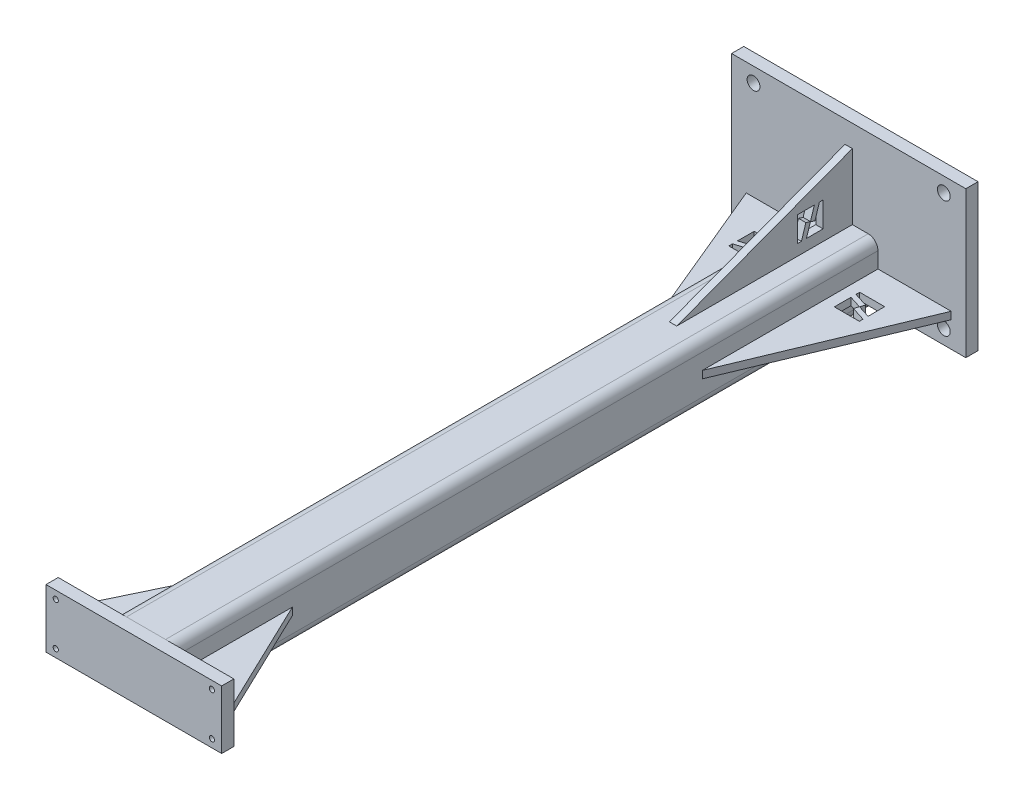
ISO-10303-21;
HEADER;
FILE_DESCRIPTION(('STEP AP214'),'2;1');
FILE_NAME('part.step','',(''),(''),'','','');
FILE_SCHEMA(('AUTOMOTIVE_DESIGN { 1 0 10303 214 1 1 1 1 }'));
ENDSEC;
DATA;
#1=APPLICATION_CONTEXT('core data for automotive mechanical design processes');
#2=APPLICATION_PROTOCOL_DEFINITION('international standard','automotive_design',2000,#1);
#3=PRODUCT_CONTEXT('',#1,'mechanical');
#4=PRODUCT('Part','Part','',(#3));
#5=PRODUCT_RELATED_PRODUCT_CATEGORY('part','',(#4));
#6=PRODUCT_DEFINITION_FORMATION('','',#4);
#7=PRODUCT_DEFINITION_CONTEXT('part definition',#1,'design');
#8=PRODUCT_DEFINITION('design','',#6,#7);
#9=PRODUCT_DEFINITION_SHAPE('','',#8);
#10=(LENGTH_UNIT() NAMED_UNIT(*) SI_UNIT(.MILLI.,.METRE.));
#11=(NAMED_UNIT(*) PLANE_ANGLE_UNIT() SI_UNIT($,.RADIAN.));
#12=(NAMED_UNIT(*) SI_UNIT($,.STERADIAN.) SOLID_ANGLE_UNIT());
#13=UNCERTAINTY_MEASURE_WITH_UNIT(LENGTH_MEASURE(1.E-05),#10,'distance_accuracy_value','');
#14=(GEOMETRIC_REPRESENTATION_CONTEXT(3) GLOBAL_UNCERTAINTY_ASSIGNED_CONTEXT((#13)) GLOBAL_UNIT_ASSIGNED_CONTEXT((#10,
#11,#12)) REPRESENTATION_CONTEXT('',''));
#15=CARTESIAN_POINT('',(0.,0.,0.));
#16=DIRECTION('',(0.,0.,1.));
#17=DIRECTION('',(1.,0.,0.));
#18=AXIS2_PLACEMENT_3D('',#15,#16,#17);
#19=CARTESIAN_POINT('',(-111.125,4.76250000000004,0.));
#20=DIRECTION('',(0.,0.,-1.));
#21=DIRECTION('',(1.,0.,0.));
#22=AXIS2_PLACEMENT_3D('',#19,#20,#21);
#23=PLANE('',#22);
#24=DIRECTION('',(-1.,0.,0.));
#25=VECTOR('',#24,1.);
#26=CARTESIAN_POINT('',(-111.125,-4.76249999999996,0.));
#27=LINE('',#26,#25);
#28=CARTESIAN_POINT('',(-38.1,-4.76249999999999,0.));
#29=VERTEX_POINT('',#28);
#30=CARTESIAN_POINT('',(-111.125,-4.76249999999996,0.));
#31=VERTEX_POINT('',#30);
#32=EDGE_CURVE('E146',#29,#31,#27,.T.);
#33=ORIENTED_EDGE('',*,*,#32,.F.);
#34=DIRECTION('',(0.,-1.,0.));
#35=VECTOR('',#34,1.);
#36=CARTESIAN_POINT('',(-38.1,4.76250000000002,0.));
#37=LINE('',#36,#35);
#38=CARTESIAN_POINT('',(-38.1,4.76250000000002,0.));
#39=VERTEX_POINT('',#38);
#40=EDGE_CURVE('E141',#39,#29,#37,.T.);
#41=ORIENTED_EDGE('',*,*,#40,.F.);
#42=DIRECTION('',(-1.,0.,0.));
#43=VECTOR('',#42,1.);
#44=CARTESIAN_POINT('',(-111.125,4.76250000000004,0.));
#45=LINE('',#44,#43);
#46=CARTESIAN_POINT('',(-111.125,4.76250000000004,0.));
#47=VERTEX_POINT('',#46);
#48=EDGE_CURVE('E133',#39,#47,#45,.T.);
#49=ORIENTED_EDGE('',*,*,#48,.T.);
#50=DIRECTION('',(0.,-1.,0.));
#51=VECTOR('',#50,1.);
#52=CARTESIAN_POINT('',(-111.125,4.76250000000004,0.));
#53=LINE('',#52,#51);
#54=EDGE_CURVE('E13',#47,#31,#53,.T.);
#55=ORIENTED_EDGE('',*,*,#54,.T.);
#56=EDGE_LOOP('',(#33,#41,#49,#55));
#57=FACE_BOUND('',#56,.T.);
#58=ADVANCED_FACE('F94',(#57),#23,.F.);
#59=CARTESIAN_POINT('',(-111.125,4.76250000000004,0.));
#60=DIRECTION('',(0.901816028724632,0.,0.432120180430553));
#61=DIRECTION('',(-0.432120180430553,0.,0.901816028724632));
#62=AXIS2_PLACEMENT_3D('',#59,#60,#61);
#63=PLANE('',#62);
#64=DIRECTION('',(0.432120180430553,0.,-0.901816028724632));
#65=VECTOR('',#64,1.);
#66=CARTESIAN_POINT('',(-111.125,-4.76249999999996,0.));
#67=LINE('',#66,#65);
#68=CARTESIAN_POINT('',(-38.1,-4.76249999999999,-152.4));
#69=VERTEX_POINT('',#68);
#70=EDGE_CURVE('E138',#31,#69,#67,.T.);
#71=ORIENTED_EDGE('',*,*,#70,.F.);
#72=ORIENTED_EDGE('',*,*,#54,.F.);
#73=DIRECTION('',(0.432120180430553,0.,-0.901816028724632));
#74=VECTOR('',#73,1.);
#75=CARTESIAN_POINT('',(-111.125,4.76250000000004,0.));
#76=LINE('',#75,#74);
#77=CARTESIAN_POINT('',(-38.1,4.76250000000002,-152.4));
#78=VERTEX_POINT('',#77);
#79=EDGE_CURVE('E129',#47,#78,#76,.T.);
#80=ORIENTED_EDGE('',*,*,#79,.T.);
#81=DIRECTION('',(0.,-1.,0.));
#82=VECTOR('',#81,1.);
#83=CARTESIAN_POINT('',(-38.1,4.76250000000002,-152.4));
#84=LINE('',#83,#82);
#85=EDGE_CURVE('E102',#78,#69,#84,.T.);
#86=ORIENTED_EDGE('',*,*,#85,.T.);
#87=EDGE_LOOP('',(#71,#72,#80,#86));
#88=FACE_BOUND('',#87,.T.);
#89=ADVANCED_FACE('F137',(#88),#63,.F.);
#90=CARTESIAN_POINT('',(-38.1,4.76250000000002,0.));
#91=DIRECTION('',(-1.,0.,0.));
#92=DIRECTION('',(0.,0.,-1.));
#93=AXIS2_PLACEMENT_3D('',#90,#91,#92);
#94=PLANE('',#93);
#95=DIRECTION('',(0.,0.,1.));
#96=VECTOR('',#95,1.);
#97=CARTESIAN_POINT('',(-38.1,-4.76249999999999,0.));
#98=LINE('',#97,#96);
#99=EDGE_CURVE('E121',#69,#29,#98,.T.);
#100=ORIENTED_EDGE('',*,*,#99,.F.);
#101=ORIENTED_EDGE('',*,*,#85,.F.);
#102=DIRECTION('',(0.,0.,1.));
#103=VECTOR('',#102,1.);
#104=CARTESIAN_POINT('',(-38.1,4.76250000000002,0.));
#105=LINE('',#104,#103);
#106=EDGE_CURVE('E110',#78,#39,#105,.T.);
#107=ORIENTED_EDGE('',*,*,#106,.T.);
#108=ORIENTED_EDGE('',*,*,#40,.T.);
#109=EDGE_LOOP('',(#100,#101,#107,#108));
#110=FACE_BOUND('',#109,.T.);
#111=ADVANCED_FACE('F155',(#110),#94,.F.);
#112=CARTESIAN_POINT('',(0.,4.7625,0.));
#113=DIRECTION('',(0.,-1.,0.));
#114=DIRECTION('',(0.,0.,-1.));
#115=AXIS2_PLACEMENT_3D('',#112,#113,#114);
#116=PLANE('',#115);
#117=ORIENTED_EDGE('',*,*,#48,.F.);
#118=ORIENTED_EDGE('',*,*,#106,.F.);
#119=ORIENTED_EDGE('',*,*,#79,.F.);
#120=EDGE_LOOP('',(#117,#118,#119));
#121=FACE_BOUND('',#120,.T.);
#122=ADVANCED_FACE('F131',(#121),#116,.F.);
#123=CARTESIAN_POINT('',(0.,-4.7625,0.));
#124=DIRECTION('',(0.,-1.,0.));
#125=DIRECTION('',(0.,0.,-1.));
#126=AXIS2_PLACEMENT_3D('',#123,#124,#125);
#127=PLANE('',#126);
#128=ORIENTED_EDGE('',*,*,#32,.T.);
#129=ORIENTED_EDGE('',*,*,#70,.T.);
#130=ORIENTED_EDGE('',*,*,#99,.T.);
#131=EDGE_LOOP('',(#128,#129,#130));
#132=FACE_BOUND('',#131,.T.);
#133=ADVANCED_FACE('F149',(#132),#127,.T.);
#134=CLOSED_SHELL('',(#58,#89,#111,#122,#133));
#135=MANIFOLD_SOLID_BREP('B2',#134);
#136=CARTESIAN_POINT('',(111.125,4.7625,0.));
#137=DIRECTION('',(0.,0.,-1.));
#138=DIRECTION('',(-1.,0.,0.));
#139=AXIS2_PLACEMENT_3D('',#136,#137,#138);
#140=PLANE('',#139);
#141=DIRECTION('',(1.,0.,0.));
#142=VECTOR('',#141,1.);
#143=CARTESIAN_POINT('',(111.125,-4.7625,0.));
#144=LINE('',#143,#142);
#145=CARTESIAN_POINT('',(38.1,-4.7625,0.));
#146=VERTEX_POINT('',#145);
#147=CARTESIAN_POINT('',(111.125,-4.7625,0.));
#148=VERTEX_POINT('',#147);
#149=EDGE_CURVE('E249',#146,#148,#144,.T.);
#150=ORIENTED_EDGE('',*,*,#149,.T.);
#151=DIRECTION('',(0.,-1.,0.));
#152=VECTOR('',#151,1.);
#153=CARTESIAN_POINT('',(111.125,4.7625,0.));
#154=LINE('',#153,#152);
#155=CARTESIAN_POINT('',(111.125,4.7625,0.));
#156=VERTEX_POINT('',#155);
#157=EDGE_CURVE('E92',#156,#148,#154,.T.);
#158=ORIENTED_EDGE('',*,*,#157,.F.);
#159=DIRECTION('',(1.,0.,0.));
#160=VECTOR('',#159,1.);
#161=CARTESIAN_POINT('',(111.125,4.7625,0.));
#162=LINE('',#161,#160);
#163=CARTESIAN_POINT('',(38.1,4.7625,0.));
#164=VERTEX_POINT('',#163);
#165=EDGE_CURVE('E242',#164,#156,#162,.T.);
#166=ORIENTED_EDGE('',*,*,#165,.F.);
#167=DIRECTION('',(0.,-1.,0.));
#168=VECTOR('',#167,1.);
#169=CARTESIAN_POINT('',(38.1,4.7625,0.));
#170=LINE('',#169,#168);
#171=EDGE_CURVE('E250',#164,#146,#170,.T.);
#172=ORIENTED_EDGE('',*,*,#171,.T.);
#173=EDGE_LOOP('',(#150,#158,#166,#172));
#174=FACE_BOUND('',#173,.T.);
#175=ADVANCED_FACE('F202',(#174),#140,.F.);
#176=CARTESIAN_POINT('',(111.125,4.7625,0.));
#177=DIRECTION('',(-0.901816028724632,0.,0.432120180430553));
#178=DIRECTION('',(0.432120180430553,0.,0.901816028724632));
#179=AXIS2_PLACEMENT_3D('',#176,#177,#178);
#180=PLANE('',#179);
#181=DIRECTION('',(-0.432120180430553,0.,-0.901816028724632));
#182=VECTOR('',#181,1.);
#183=CARTESIAN_POINT('',(111.125,-4.7625,0.));
#184=LINE('',#183,#182);
#185=CARTESIAN_POINT('',(38.1,-4.7625,-152.4));
#186=VERTEX_POINT('',#185);
#187=EDGE_CURVE('E230',#148,#186,#184,.T.);
#188=ORIENTED_EDGE('',*,*,#187,.T.);
#189=DIRECTION('',(0.,-1.,0.));
#190=VECTOR('',#189,1.);
#191=CARTESIAN_POINT('',(38.1,4.7625,-152.4));
#192=LINE('',#191,#190);
#193=CARTESIAN_POINT('',(38.1,4.7625,-152.4));
#194=VERTEX_POINT('',#193);
#195=EDGE_CURVE('E210',#194,#186,#192,.T.);
#196=ORIENTED_EDGE('',*,*,#195,.F.);
#197=DIRECTION('',(-0.432120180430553,0.,-0.901816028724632));
#198=VECTOR('',#197,1.);
#199=CARTESIAN_POINT('',(111.125,4.7625,0.));
#200=LINE('',#199,#198);
#201=EDGE_CURVE('E238',#156,#194,#200,.T.);
#202=ORIENTED_EDGE('',*,*,#201,.F.);
#203=ORIENTED_EDGE('',*,*,#157,.T.);
#204=EDGE_LOOP('',(#188,#196,#202,#203));
#205=FACE_BOUND('',#204,.T.);
#206=ADVANCED_FACE('F239',(#205),#180,.F.);
#207=CARTESIAN_POINT('',(38.1,4.7625,0.));
#208=DIRECTION('',(1.,0.,0.));
#209=DIRECTION('',(0.,0.,-1.));
#210=AXIS2_PLACEMENT_3D('',#207,#208,#209);
#211=PLANE('',#210);
#212=DIRECTION('',(0.,0.,1.));
#213=VECTOR('',#212,1.);
#214=CARTESIAN_POINT('',(38.1,-4.7625,0.));
#215=LINE('',#214,#213);
#216=EDGE_CURVE('E235',#186,#146,#215,.T.);
#217=ORIENTED_EDGE('',*,*,#216,.T.);
#218=ORIENTED_EDGE('',*,*,#171,.F.);
#219=DIRECTION('',(0.,0.,1.));
#220=VECTOR('',#219,1.);
#221=CARTESIAN_POINT('',(38.1,4.7625,0.));
#222=LINE('',#221,#220);
#223=EDGE_CURVE('E218',#194,#164,#222,.T.);
#224=ORIENTED_EDGE('',*,*,#223,.F.);
#225=ORIENTED_EDGE('',*,*,#195,.T.);
#226=EDGE_LOOP('',(#217,#218,#224,#225));
#227=FACE_BOUND('',#226,.T.);
#228=ADVANCED_FACE('F257',(#227),#211,.F.);
#229=CARTESIAN_POINT('',(0.,4.7625,0.));
#230=DIRECTION('',(0.,-1.,0.));
#231=DIRECTION('',(0.,0.,-1.));
#232=AXIS2_PLACEMENT_3D('',#229,#230,#231);
#233=PLANE('',#232);
#234=ORIENTED_EDGE('',*,*,#165,.T.);
#235=ORIENTED_EDGE('',*,*,#201,.T.);
#236=ORIENTED_EDGE('',*,*,#223,.T.);
#237=EDGE_LOOP('',(#234,#235,#236));
#238=FACE_BOUND('',#237,.T.);
#239=ADVANCED_FACE('F245',(#238),#233,.F.);
#240=CARTESIAN_POINT('',(0.,-4.7625,0.));
#241=DIRECTION('',(0.,-1.,0.));
#242=DIRECTION('',(0.,0.,-1.));
#243=AXIS2_PLACEMENT_3D('',#240,#241,#242);
#244=PLANE('',#243);
#245=ORIENTED_EDGE('',*,*,#149,.F.);
#246=ORIENTED_EDGE('',*,*,#216,.F.);
#247=ORIENTED_EDGE('',*,*,#187,.F.);
#248=EDGE_LOOP('',(#245,#246,#247));
#249=FACE_BOUND('',#248,.T.);
#250=ADVANCED_FACE('F258',(#249),#244,.T.);
#251=CLOSED_SHELL('',(#175,#206,#228,#239,#250));
#252=MANIFOLD_SOLID_BREP('B7',#251);
#253=CARTESIAN_POINT('',(0.,0.,15.875));
#254=DIRECTION('',(0.,0.,1.));
#255=DIRECTION('',(1.,0.,0.));
#256=AXIS2_PLACEMENT_3D('',#253,#254,#255);
#257=PLANE('',#256);
#258=DIRECTION('',(-1.,0.,0.));
#259=VECTOR('',#258,1.);
#260=CARTESIAN_POINT('',(114.3,38.1,15.875));
#261=LINE('',#260,#259);
#262=CARTESIAN_POINT('',(114.3,38.1,15.875));
#263=VERTEX_POINT('',#262);
#264=CARTESIAN_POINT('',(-114.3,38.1,15.875));
#265=VERTEX_POINT('',#264);
#266=EDGE_CURVE('E362',#263,#265,#261,.T.);
#267=ORIENTED_EDGE('',*,*,#266,.T.);
#268=DIRECTION('',(0.,-1.,0.));
#269=VECTOR('',#268,1.);
#270=CARTESIAN_POINT('',(-114.3,38.1,15.875));
#271=LINE('',#270,#269);
#272=CARTESIAN_POINT('',(-114.3,-38.1,15.875));
#273=VERTEX_POINT('',#272);
#274=EDGE_CURVE('E357',#265,#273,#271,.T.);
#275=ORIENTED_EDGE('',*,*,#274,.T.);
#276=DIRECTION('',(1.,0.,0.));
#277=VECTOR('',#276,1.);
#278=CARTESIAN_POINT('',(-114.3,-38.1,15.875));
#279=LINE('',#278,#277);
#280=CARTESIAN_POINT('',(114.3,-38.1,15.875));
#281=VERTEX_POINT('',#280);
#282=EDGE_CURVE('E360',#273,#281,#279,.T.);
#283=ORIENTED_EDGE('',*,*,#282,.T.);
#284=DIRECTION('',(0.,1.,0.));
#285=VECTOR('',#284,1.);
#286=CARTESIAN_POINT('',(114.3,-38.1,15.875));
#287=LINE('',#286,#285);
#288=EDGE_CURVE('E327',#281,#263,#287,.T.);
#289=ORIENTED_EDGE('',*,*,#288,.T.);
#290=EDGE_LOOP('',(#267,#275,#283,#289));
#291=FACE_BOUND('',#290,.T.);
#292=CARTESIAN_POINT('',(-101.6,-27.7749,15.875));
#293=DIRECTION('',(0.,0.,-1.));
#294=DIRECTION('',(-1.,0.,0.));
#295=AXIS2_PLACEMENT_3D('',#292,#293,#294);
#296=CIRCLE('',#295,3.3782);
#297=CARTESIAN_POINT('',(-104.9782,-27.7749,15.875));
#298=VERTEX_POINT('',#297);
#299=EDGE_CURVE('E377',#298,#298,#296,.T.);
#300=ORIENTED_EDGE('',*,*,#299,.T.);
#301=EDGE_LOOP('',(#300));
#302=FACE_BOUND('',#301,.T.);
#303=CARTESIAN_POINT('',(-101.6,27.7749,15.875));
#304=DIRECTION('',(0.,0.,-1.));
#305=DIRECTION('',(-1.,0.,0.));
#306=AXIS2_PLACEMENT_3D('',#303,#304,#305);
#307=CIRCLE('',#306,3.3782);
#308=CARTESIAN_POINT('',(-104.9782,27.7749,15.875));
#309=VERTEX_POINT('',#308);
#310=EDGE_CURVE('E393',#309,#309,#307,.T.);
#311=ORIENTED_EDGE('',*,*,#310,.T.);
#312=EDGE_LOOP('',(#311));
#313=FACE_BOUND('',#312,.T.);
#314=CARTESIAN_POINT('',(101.6,-27.7749,15.875));
#315=DIRECTION('',(0.,0.,-1.));
#316=DIRECTION('',(-1.,0.,0.));
#317=AXIS2_PLACEMENT_3D('',#314,#315,#316);
#318=CIRCLE('',#317,3.3782);
#319=CARTESIAN_POINT('',(98.2218,-27.7749,15.875));
#320=VERTEX_POINT('',#319);
#321=EDGE_CURVE('E399',#320,#320,#318,.T.);
#322=ORIENTED_EDGE('',*,*,#321,.T.);
#323=EDGE_LOOP('',(#322));
#324=FACE_BOUND('',#323,.T.);
#325=CARTESIAN_POINT('',(101.6,27.7749,15.875));
#326=DIRECTION('',(0.,0.,-1.));
#327=DIRECTION('',(-1.,0.,0.));
#328=AXIS2_PLACEMENT_3D('',#325,#326,#327);
#329=CIRCLE('',#328,3.3782);
#330=CARTESIAN_POINT('',(98.2218000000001,27.7749,15.875));
#331=VERTEX_POINT('',#330);
#332=EDGE_CURVE('E405',#331,#331,#329,.T.);
#333=ORIENTED_EDGE('',*,*,#332,.T.);
#334=EDGE_LOOP('',(#333));
#335=FACE_BOUND('',#334,.T.);
#336=ADVANCED_FACE('F310',(#291,#302,#313,#324,#335),#257,.T.);
#337=CARTESIAN_POINT('',(114.3,38.1,15.875));
#338=DIRECTION('',(0.,-1.,0.));
#339=DIRECTION('',(1.,0.,0.));
#340=AXIS2_PLACEMENT_3D('',#337,#338,#339);
#341=PLANE('',#340);
#342=DIRECTION('',(-1.,0.,0.));
#343=VECTOR('',#342,1.);
#344=CARTESIAN_POINT('',(114.3,38.1,0.));
#345=LINE('',#344,#343);
#346=CARTESIAN_POINT('',(114.3,38.1,0.));
#347=VERTEX_POINT('',#346);
#348=CARTESIAN_POINT('',(-114.3,38.1,0.));
#349=VERTEX_POINT('',#348);
#350=EDGE_CURVE('E374',#347,#349,#345,.T.);
#351=ORIENTED_EDGE('',*,*,#350,.T.);
#352=DIRECTION('',(0.,0.,-1.));
#353=VECTOR('',#352,1.);
#354=CARTESIAN_POINT('',(-114.3,38.1,15.875));
#355=LINE('',#354,#353);
#356=EDGE_CURVE('E200',#265,#349,#355,.T.);
#357=ORIENTED_EDGE('',*,*,#356,.F.);
#358=ORIENTED_EDGE('',*,*,#266,.F.);
#359=DIRECTION('',(0.,0.,-1.));
#360=VECTOR('',#359,1.);
#361=CARTESIAN_POINT('',(114.3,38.1,15.875));
#362=LINE('',#361,#360);
#363=EDGE_CURVE('E370',#263,#347,#362,.T.);
#364=ORIENTED_EDGE('',*,*,#363,.T.);
#365=EDGE_LOOP('',(#351,#357,#358,#364));
#366=FACE_BOUND('',#365,.T.);
#367=ADVANCED_FACE('F312',(#366),#341,.F.);
#368=CARTESIAN_POINT('',(-114.3,38.1,15.875));
#369=DIRECTION('',(1.,0.,0.));
#370=DIRECTION('',(0.,1.,0.));
#371=AXIS2_PLACEMENT_3D('',#368,#369,#370);
#372=PLANE('',#371);
#373=DIRECTION('',(0.,-1.,0.));
#374=VECTOR('',#373,1.);
#375=CARTESIAN_POINT('',(-114.3,38.1,0.));
#376=LINE('',#375,#374);
#377=CARTESIAN_POINT('',(-114.3,-38.1,0.));
#378=VERTEX_POINT('',#377);
#379=EDGE_CURVE('E366',#349,#378,#376,.T.);
#380=ORIENTED_EDGE('',*,*,#379,.T.);
#381=DIRECTION('',(0.,0.,-1.));
#382=VECTOR('',#381,1.);
#383=CARTESIAN_POINT('',(-114.3,-38.1,15.875));
#384=LINE('',#383,#382);
#385=EDGE_CURVE('E319',#273,#378,#384,.T.);
#386=ORIENTED_EDGE('',*,*,#385,.F.);
#387=ORIENTED_EDGE('',*,*,#274,.F.);
#388=ORIENTED_EDGE('',*,*,#356,.T.);
#389=EDGE_LOOP('',(#380,#386,#387,#388));
#390=FACE_BOUND('',#389,.T.);
#391=ADVANCED_FACE('F365',(#390),#372,.F.);
#392=CARTESIAN_POINT('',(-114.3,-38.1,15.875));
#393=DIRECTION('',(0.,1.,0.));
#394=DIRECTION('',(-1.,0.,0.));
#395=AXIS2_PLACEMENT_3D('',#392,#393,#394);
#396=PLANE('',#395);
#397=DIRECTION('',(1.,0.,0.));
#398=VECTOR('',#397,1.);
#399=CARTESIAN_POINT('',(-114.3,-38.1,0.));
#400=LINE('',#399,#398);
#401=CARTESIAN_POINT('',(114.3,-38.1,0.));
#402=VERTEX_POINT('',#401);
#403=EDGE_CURVE('E344',#378,#402,#400,.T.);
#404=ORIENTED_EDGE('',*,*,#403,.T.);
#405=DIRECTION('',(0.,0.,-1.));
#406=VECTOR('',#405,1.);
#407=CARTESIAN_POINT('',(114.3,-38.1,15.875));
#408=LINE('',#407,#406);
#409=EDGE_CURVE('E367',#281,#402,#408,.T.);
#410=ORIENTED_EDGE('',*,*,#409,.F.);
#411=ORIENTED_EDGE('',*,*,#282,.F.);
#412=ORIENTED_EDGE('',*,*,#385,.T.);
#413=EDGE_LOOP('',(#404,#410,#411,#412));
#414=FACE_BOUND('',#413,.T.);
#415=ADVANCED_FACE('F368',(#414),#396,.F.);
#416=CARTESIAN_POINT('',(114.3,-38.1,15.875));
#417=DIRECTION('',(-1.,0.,0.));
#418=DIRECTION('',(0.,-1.,0.));
#419=AXIS2_PLACEMENT_3D('',#416,#417,#418);
#420=PLANE('',#419);
#421=DIRECTION('',(0.,1.,0.));
#422=VECTOR('',#421,1.);
#423=CARTESIAN_POINT('',(114.3,-38.1,0.));
#424=LINE('',#423,#422);
#425=EDGE_CURVE('E350',#402,#347,#424,.T.);
#426=ORIENTED_EDGE('',*,*,#425,.T.);
#427=ORIENTED_EDGE('',*,*,#363,.F.);
#428=ORIENTED_EDGE('',*,*,#288,.F.);
#429=ORIENTED_EDGE('',*,*,#409,.T.);
#430=EDGE_LOOP('',(#426,#427,#428,#429));
#431=FACE_BOUND('',#430,.T.);
#432=ADVANCED_FACE('F382',(#431),#420,.F.);
#433=CARTESIAN_POINT('',(0.,0.,0.));
#434=DIRECTION('',(0.,0.,1.));
#435=DIRECTION('',(1.,0.,0.));
#436=AXIS2_PLACEMENT_3D('',#433,#434,#435);
#437=PLANE('',#436);
#438=CARTESIAN_POINT('',(101.6,27.7749,0.));
#439=DIRECTION('',(0.,0.,-1.));
#440=DIRECTION('',(-1.,0.,0.));
#441=AXIS2_PLACEMENT_3D('',#438,#439,#440);
#442=CIRCLE('',#441,3.3782);
#443=CARTESIAN_POINT('',(98.2218000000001,27.7749,0.));
#444=VERTEX_POINT('',#443);
#445=EDGE_CURVE('E408',#444,#444,#442,.T.);
#446=ORIENTED_EDGE('',*,*,#445,.F.);
#447=EDGE_LOOP('',(#446));
#448=FACE_BOUND('',#447,.T.);
#449=CARTESIAN_POINT('',(101.6,-27.7749,0.));
#450=DIRECTION('',(0.,0.,-1.));
#451=DIRECTION('',(-1.,0.,0.));
#452=AXIS2_PLACEMENT_3D('',#449,#450,#451);
#453=CIRCLE('',#452,3.3782);
#454=CARTESIAN_POINT('',(98.2218,-27.7749,0.));
#455=VERTEX_POINT('',#454);
#456=EDGE_CURVE('E402',#455,#455,#453,.T.);
#457=ORIENTED_EDGE('',*,*,#456,.F.);
#458=EDGE_LOOP('',(#457));
#459=FACE_BOUND('',#458,.T.);
#460=CARTESIAN_POINT('',(-101.6,27.7749,0.));
#461=DIRECTION('',(0.,0.,-1.));
#462=DIRECTION('',(-1.,0.,0.));
#463=AXIS2_PLACEMENT_3D('',#460,#461,#462);
#464=CIRCLE('',#463,3.3782);
#465=CARTESIAN_POINT('',(-104.9782,27.7749,0.));
#466=VERTEX_POINT('',#465);
#467=EDGE_CURVE('E396',#466,#466,#464,.T.);
#468=ORIENTED_EDGE('',*,*,#467,.F.);
#469=EDGE_LOOP('',(#468));
#470=FACE_BOUND('',#469,.T.);
#471=CARTESIAN_POINT('',(-101.6,-27.7749,0.));
#472=DIRECTION('',(0.,0.,-1.));
#473=DIRECTION('',(-1.,0.,0.));
#474=AXIS2_PLACEMENT_3D('',#471,#472,#473);
#475=CIRCLE('',#474,3.3782);
#476=CARTESIAN_POINT('',(-104.9782,-27.7749,0.));
#477=VERTEX_POINT('',#476);
#478=EDGE_CURVE('E390',#477,#477,#475,.T.);
#479=ORIENTED_EDGE('',*,*,#478,.F.);
#480=EDGE_LOOP('',(#479));
#481=FACE_BOUND('',#480,.T.);
#482=ORIENTED_EDGE('',*,*,#350,.F.);
#483=ORIENTED_EDGE('',*,*,#425,.F.);
#484=ORIENTED_EDGE('',*,*,#403,.F.);
#485=ORIENTED_EDGE('',*,*,#379,.F.);
#486=EDGE_LOOP('',(#482,#483,#484,#485));
#487=FACE_BOUND('',#486,.T.);
#488=ADVANCED_FACE('F385',(#448,#459,#470,#481,#487),#437,.F.);
#489=CARTESIAN_POINT('',(-101.6,-27.7749,0.));
#490=DIRECTION('',(0.,0.,-1.));
#491=DIRECTION('',(-1.,0.,0.));
#492=AXIS2_PLACEMENT_3D('',#489,#490,#491);
#493=CYLINDRICAL_SURFACE('',#492,3.3782);
#494=ORIENTED_EDGE('',*,*,#299,.F.);
#495=EDGE_LOOP('',(#494));
#496=FACE_BOUND('',#495,.T.);
#497=ORIENTED_EDGE('',*,*,#478,.T.);
#498=EDGE_LOOP('',(#497));
#499=FACE_BOUND('',#498,.T.);
#500=ADVANCED_FACE('F416',(#496,#499),#493,.F.);
#501=CARTESIAN_POINT('',(-101.6,27.7749,0.));
#502=DIRECTION('',(0.,0.,-1.));
#503=DIRECTION('',(-1.,0.,0.));
#504=AXIS2_PLACEMENT_3D('',#501,#502,#503);
#505=CYLINDRICAL_SURFACE('',#504,3.3782);
#506=ORIENTED_EDGE('',*,*,#310,.F.);
#507=EDGE_LOOP('',(#506));
#508=FACE_BOUND('',#507,.T.);
#509=ORIENTED_EDGE('',*,*,#467,.T.);
#510=EDGE_LOOP('',(#509));
#511=FACE_BOUND('',#510,.T.);
#512=ADVANCED_FACE('F425',(#508,#511),#505,.F.);
#513=CARTESIAN_POINT('',(101.6,-27.7749,0.));
#514=DIRECTION('',(0.,0.,-1.));
#515=DIRECTION('',(-1.,0.,0.));
#516=AXIS2_PLACEMENT_3D('',#513,#514,#515);
#517=CYLINDRICAL_SURFACE('',#516,3.3782);
#518=ORIENTED_EDGE('',*,*,#321,.F.);
#519=EDGE_LOOP('',(#518));
#520=FACE_BOUND('',#519,.T.);
#521=ORIENTED_EDGE('',*,*,#456,.T.);
#522=EDGE_LOOP('',(#521));
#523=FACE_BOUND('',#522,.T.);
#524=ADVANCED_FACE('F431',(#520,#523),#517,.F.);
#525=CARTESIAN_POINT('',(101.6,27.7749,0.));
#526=DIRECTION('',(0.,0.,-1.));
#527=DIRECTION('',(-1.,0.,0.));
#528=AXIS2_PLACEMENT_3D('',#525,#526,#527);
#529=CYLINDRICAL_SURFACE('',#528,3.3782);
#530=ORIENTED_EDGE('',*,*,#332,.F.);
#531=EDGE_LOOP('',(#530));
#532=FACE_BOUND('',#531,.T.);
#533=ORIENTED_EDGE('',*,*,#445,.T.);
#534=EDGE_LOOP('',(#533));
#535=FACE_BOUND('',#534,.T.);
#536=ADVANCED_FACE('F412',(#532,#535),#529,.F.);
#537=CLOSED_SHELL('',(#336,#367,#391,#415,#432,#488,#500,#512,#524,#536));
#538=MANIFOLD_SOLID_BREP('B86',#537);
#539=CARTESIAN_POINT('',(38.1,-4.7625,-685.8));
#540=DIRECTION('',(-0.923076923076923,0.,-0.384615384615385));
#541=DIRECTION('',(0.384615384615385,0.,-0.923076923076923));
#542=AXIS2_PLACEMENT_3D('',#539,#540,#541);
#543=PLANE('',#542);
#544=DIRECTION('',(0.384615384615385,0.,-0.923076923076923));
#545=VECTOR('',#544,1.);
#546=CARTESIAN_POINT('',(38.1,4.7625,-685.8));
#547=LINE('',#546,#545);
#548=CARTESIAN_POINT('',(38.1,4.7625,-685.8));
#549=VERTEX_POINT('',#548);
#550=CARTESIAN_POINT('',(133.35,4.76249999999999,-914.4));
#551=VERTEX_POINT('',#550);
#552=EDGE_CURVE('E735',#549,#551,#547,.T.);
#553=ORIENTED_EDGE('',*,*,#552,.F.);
#554=DIRECTION('',(0.,1.,0.));
#555=VECTOR('',#554,1.);
#556=CARTESIAN_POINT('',(38.1,-4.7625,-685.8));
#557=LINE('',#556,#555);
#558=CARTESIAN_POINT('',(38.1,-4.7625,-685.8));
#559=VERTEX_POINT('',#558);
#560=EDGE_CURVE('E745',#559,#549,#557,.T.);
#561=ORIENTED_EDGE('',*,*,#560,.F.);
#562=DIRECTION('',(0.384615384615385,0.,-0.923076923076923));
#563=VECTOR('',#562,1.);
#564=CARTESIAN_POINT('',(38.1,-4.7625,-685.8));
#565=LINE('',#564,#563);
#566=CARTESIAN_POINT('',(133.35,-4.76250000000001,-914.4));
#567=VERTEX_POINT('',#566);
#568=EDGE_CURVE('E736',#559,#567,#565,.T.);
#569=ORIENTED_EDGE('',*,*,#568,.T.);
#570=DIRECTION('',(0.,1.,0.));
#571=VECTOR('',#570,1.);
#572=CARTESIAN_POINT('',(133.35,-4.76250000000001,-914.4));
#573=LINE('',#572,#571);
#574=EDGE_CURVE('E308',#567,#551,#573,.T.);
#575=ORIENTED_EDGE('',*,*,#574,.T.);
#576=EDGE_LOOP('',(#553,#561,#569,#575));
#577=FACE_BOUND('',#576,.T.);
#578=ADVANCED_FACE('F528',(#577),#543,.F.);
#579=CARTESIAN_POINT('',(38.1,-4.7625,-914.4));
#580=DIRECTION('',(0.,0.,1.));
#581=DIRECTION('',(-1.,0.,0.));
#582=AXIS2_PLACEMENT_3D('',#579,#580,#581);
#583=PLANE('',#582);
#584=DIRECTION('',(-1.,0.,0.));
#585=VECTOR('',#584,1.);
#586=CARTESIAN_POINT('',(38.1,4.7625,-914.4));
#587=LINE('',#586,#585);
#588=CARTESIAN_POINT('',(38.1,4.7625,-914.4));
#589=VERTEX_POINT('',#588);
#590=EDGE_CURVE('E748',#551,#589,#587,.T.);
#591=ORIENTED_EDGE('',*,*,#590,.F.);
#592=ORIENTED_EDGE('',*,*,#574,.F.);
#593=DIRECTION('',(-1.,0.,0.));
#594=VECTOR('',#593,1.);
#595=CARTESIAN_POINT('',(38.1,-4.7625,-914.4));
#596=LINE('',#595,#594);
#597=CARTESIAN_POINT('',(38.1,-4.7625,-914.4));
#598=VERTEX_POINT('',#597);
#599=EDGE_CURVE('E739',#567,#598,#596,.T.);
#600=ORIENTED_EDGE('',*,*,#599,.T.);
#601=DIRECTION('',(0.,1.,0.));
#602=VECTOR('',#601,1.);
#603=CARTESIAN_POINT('',(38.1,-4.7625,-914.4));
#604=LINE('',#603,#602);
#605=EDGE_CURVE('E535',#598,#589,#604,.T.);
#606=ORIENTED_EDGE('',*,*,#605,.T.);
#607=EDGE_LOOP('',(#591,#592,#600,#606));
#608=FACE_BOUND('',#607,.T.);
#609=ADVANCED_FACE('F756',(#608),#583,.F.);
#610=CARTESIAN_POINT('',(38.1,-4.7625,-914.4));
#611=DIRECTION('',(1.,0.,0.));
#612=DIRECTION('',(0.,-1.,0.));
#613=AXIS2_PLACEMENT_3D('',#610,#611,#612);
#614=PLANE('',#613);
#615=DIRECTION('',(0.,0.,1.));
#616=VECTOR('',#615,1.);
#617=CARTESIAN_POINT('',(38.1,4.7625,-914.4));
#618=LINE('',#617,#616);
#619=EDGE_CURVE('E740',#589,#549,#618,.T.);
#620=ORIENTED_EDGE('',*,*,#619,.F.);
#621=ORIENTED_EDGE('',*,*,#605,.F.);
#622=DIRECTION('',(0.,0.,1.));
#623=VECTOR('',#622,1.);
#624=CARTESIAN_POINT('',(38.1,-4.7625,-914.4));
#625=LINE('',#624,#623);
#626=EDGE_CURVE('E743',#598,#559,#625,.T.);
#627=ORIENTED_EDGE('',*,*,#626,.T.);
#628=ORIENTED_EDGE('',*,*,#560,.T.);
#629=EDGE_LOOP('',(#620,#621,#627,#628));
#630=FACE_BOUND('',#629,.T.);
#631=ADVANCED_FACE('F766',(#630),#614,.F.);
#632=CARTESIAN_POINT('',(0.,-4.7625,0.));
#633=DIRECTION('',(0.,1.,0.));
#634=DIRECTION('',(1.,0.,0.));
#635=AXIS2_PLACEMENT_3D('',#632,#633,#634);
#636=PLANE('',#635);
#637=DIRECTION('',(0.00262452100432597,0.,0.999996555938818));
#638=VECTOR('',#637,1.);
#639=CARTESIAN_POINT('',(87.2283594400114,-4.76250000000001,-0.228933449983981));
#640=LINE('',#639,#638);
#641=CARTESIAN_POINT('',(84.9290846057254,-4.76250000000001,-876.3));
#642=VERTEX_POINT('',#641);
#643=CARTESIAN_POINT('',(84.9859496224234,-4.76250000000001,-854.6332574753));
#644=VERTEX_POINT('',#643);
#645=EDGE_CURVE('E729',#642,#644,#640,.T.);
#646=ORIENTED_EDGE('',*,*,#645,.F.);
#647=DIRECTION('',(1.,0.,0.));
#648=VECTOR('',#647,1.);
#649=CARTESIAN_POINT('',(0.,-4.7625,-876.3));
#650=LINE('',#649,#648);
#651=CARTESIAN_POINT('',(52.3874999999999,-4.76250000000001,-876.3));
#652=VERTEX_POINT('',#651);
#653=EDGE_CURVE('E726',#652,#642,#650,.T.);
#654=ORIENTED_EDGE('',*,*,#653,.F.);
#655=DIRECTION('',(0.,0.,-1.));
#656=VECTOR('',#655,1.);
#657=CARTESIAN_POINT('',(52.3874999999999,-4.7625,0.));
#658=LINE('',#657,#656);
#659=CARTESIAN_POINT('',(52.3874999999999,-4.7625,-871.481184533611));
#660=VERTEX_POINT('',#659);
#661=EDGE_CURVE('E723',#660,#652,#658,.T.);
#662=ORIENTED_EDGE('',*,*,#661,.F.);
#663=DIRECTION('',(-0.953723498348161,0.,-0.30068503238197));
#664=VECTOR('',#663,1.);
#665=CARTESIAN_POINT('',(254.651423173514,-4.76250000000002,-807.712456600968));
#666=LINE('',#665,#664);
#667=CARTESIAN_POINT('',(70.6364076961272,-4.76250000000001,-865.727762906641));
#668=VERTEX_POINT('',#667);
#669=EDGE_CURVE('E721',#668,#660,#666,.T.);
#670=ORIENTED_EDGE('',*,*,#669,.F.);
#671=DIRECTION('',(0.289099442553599,0.,-0.957299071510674));
#672=VECTOR('',#671,1.);
#673=CARTESIAN_POINT('',(-174.861441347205,-4.76249999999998,-52.8072644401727));
#674=LINE('',#673,#672);
#675=CARTESIAN_POINT('',(68.8299385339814,-4.76250000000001,-859.745976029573));
#676=VERTEX_POINT('',#675);
#677=EDGE_CURVE('E640',#676,#668,#674,.T.);
#678=ORIENTED_EDGE('',*,*,#677,.F.);
#679=DIRECTION('',(-0.953399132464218,0.,-0.301711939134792));
#680=VECTOR('',#679,1.);
#681=CARTESIAN_POINT('',(253.573160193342,-4.76250000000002,-801.282281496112));
#682=LINE('',#681,#680);
#683=EDGE_CURVE('E732',#644,#676,#682,.T.);
#684=ORIENTED_EDGE('',*,*,#683,.F.);
#685=EDGE_LOOP('',(#646,#654,#662,#670,#678,#684));
#686=FACE_BOUND('',#685,.T.);
#687=DIRECTION('',(0.,0.,-1.));
#688=VECTOR('',#687,1.);
#689=CARTESIAN_POINT('',(52.3874999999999,-4.7625,0.));
#690=LINE('',#689,#688);
#691=CARTESIAN_POINT('',(52.3874999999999,-4.7625,-843.321072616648));
#692=VERTEX_POINT('',#691);
#693=CARTESIAN_POINT('',(52.3874999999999,-4.76250000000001,-864.97610366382));
#694=VERTEX_POINT('',#693);
#695=EDGE_CURVE('E714',#692,#694,#690,.T.);
#696=ORIENTED_EDGE('',*,*,#695,.F.);
#697=DIRECTION('',(-1.,0.,0.));
#698=VECTOR('',#697,1.);
#699=CARTESIAN_POINT('',(0.,-4.7625,-843.321072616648));
#700=LINE('',#699,#698);
#701=CARTESIAN_POINT('',(84.937882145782,-4.76250000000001,-843.321072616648));
#702=VERTEX_POINT('',#701);
#703=EDGE_CURVE('E711',#702,#692,#700,.T.);
#704=ORIENTED_EDGE('',*,*,#703,.F.);
#705=DIRECTION('',(0.,0.,1.));
#706=VECTOR('',#705,1.);
#707=CARTESIAN_POINT('',(84.937882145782,-4.76250000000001,0.));
#708=LINE('',#707,#706);
#709=CARTESIAN_POINT('',(84.937882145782,-4.76250000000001,-848.116464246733));
#710=VERTEX_POINT('',#709);
#711=EDGE_CURVE('E708',#710,#702,#708,.T.);
#712=ORIENTED_EDGE('',*,*,#711,.F.);
#713=DIRECTION('',(0.953687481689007,0.,0.30079924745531));
#714=VECTOR('',#713,1.);
#715=CARTESIAN_POINT('',(250.983073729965,-4.76250000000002,-795.744728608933));
#716=LINE('',#715,#714);
#717=CARTESIAN_POINT('',(66.6965925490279,-4.76250000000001,-853.869885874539));
#718=VERTEX_POINT('',#717);
#719=EDGE_CURVE('E706',#718,#710,#716,.T.);
#720=ORIENTED_EDGE('',*,*,#719,.F.);
#721=DIRECTION('',(-0.290216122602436,0.,0.956961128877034));
#722=VECTOR('',#721,1.);
#723=CARTESIAN_POINT('',(-176.062436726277,-4.76249999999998,-53.3941830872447));
#724=LINE('',#723,#722);
#725=CARTESIAN_POINT('',(68.5106798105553,-4.76250000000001,-859.851672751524));
#726=VERTEX_POINT('',#725);
#727=EDGE_CURVE('E696',#726,#718,#724,.T.);
#728=ORIENTED_EDGE('',*,*,#727,.F.);
#729=DIRECTION('',(0.953022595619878,0.,0.302899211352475));
#730=VECTOR('',#729,1.);
#731=CARTESIAN_POINT('',(254.498917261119,-4.76250000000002,-800.739023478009));
#732=LINE('',#731,#730);
#733=EDGE_CURVE('E717',#694,#726,#732,.T.);
#734=ORIENTED_EDGE('',*,*,#733,.F.);
#735=EDGE_LOOP('',(#696,#704,#712,#720,#728,#734));
#736=FACE_BOUND('',#735,.T.);
#737=ORIENTED_EDGE('',*,*,#568,.F.);
#738=ORIENTED_EDGE('',*,*,#626,.F.);
#739=ORIENTED_EDGE('',*,*,#599,.F.);
#740=EDGE_LOOP('',(#737,#738,#739));
#741=FACE_BOUND('',#740,.T.);
#742=ADVANCED_FACE('F765',(#686,#736,#741),#636,.F.);
#743=CARTESIAN_POINT('',(0.,4.7625,0.));
#744=DIRECTION('',(0.,1.,0.));
#745=DIRECTION('',(1.,0.,0.));
#746=AXIS2_PLACEMENT_3D('',#743,#744,#745);
#747=PLANE('',#746);
#748=DIRECTION('',(-0.953399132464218,0.,-0.301711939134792));
#749=VECTOR('',#748,1.);
#750=CARTESIAN_POINT('',(84.9859496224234,4.7625,-854.6332574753));
#751=LINE('',#750,#749);
#752=CARTESIAN_POINT('',(84.9859496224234,4.7625,-854.6332574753));
#753=VERTEX_POINT('',#752);
#754=CARTESIAN_POINT('',(68.8299385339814,4.76249999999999,-859.745976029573));
#755=VERTEX_POINT('',#754);
#756=EDGE_CURVE('E657',#753,#755,#751,.T.);
#757=ORIENTED_EDGE('',*,*,#756,.T.);
#758=DIRECTION('',(0.289099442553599,0.,-0.957299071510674));
#759=VECTOR('',#758,1.);
#760=CARTESIAN_POINT('',(68.8299385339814,4.7625,-859.745976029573));
#761=LINE('',#760,#759);
#762=CARTESIAN_POINT('',(70.6364076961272,4.7625,-865.727762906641));
#763=VERTEX_POINT('',#762);
#764=EDGE_CURVE('E637',#755,#763,#761,.T.);
#765=ORIENTED_EDGE('',*,*,#764,.T.);
#766=DIRECTION('',(-0.953723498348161,0.,-0.30068503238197));
#767=VECTOR('',#766,1.);
#768=CARTESIAN_POINT('',(70.6364076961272,4.7625,-865.727762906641));
#769=LINE('',#768,#767);
#770=CARTESIAN_POINT('',(52.3874999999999,4.76250000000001,-871.481184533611));
#771=VERTEX_POINT('',#770);
#772=EDGE_CURVE('E646',#763,#771,#769,.T.);
#773=ORIENTED_EDGE('',*,*,#772,.T.);
#774=DIRECTION('',(0.,0.,-1.));
#775=VECTOR('',#774,1.);
#776=CARTESIAN_POINT('',(52.3874999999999,4.76250000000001,-871.481184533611));
#777=LINE('',#776,#775);
#778=CARTESIAN_POINT('',(52.3874999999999,4.76250000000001,-876.3));
#779=VERTEX_POINT('',#778);
#780=EDGE_CURVE('E651',#771,#779,#777,.T.);
#781=ORIENTED_EDGE('',*,*,#780,.T.);
#782=DIRECTION('',(1.,0.,0.));
#783=VECTOR('',#782,1.);
#784=CARTESIAN_POINT('',(52.3874999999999,4.76250000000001,-876.3));
#785=LINE('',#784,#783);
#786=CARTESIAN_POINT('',(84.9290846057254,4.7625,-876.3));
#787=VERTEX_POINT('',#786);
#788=EDGE_CURVE('E662',#779,#787,#785,.T.);
#789=ORIENTED_EDGE('',*,*,#788,.T.);
#790=DIRECTION('',(0.00262452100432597,0.,0.999996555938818));
#791=VECTOR('',#790,1.);
#792=CARTESIAN_POINT('',(84.9290846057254,4.7625,-876.3));
#793=LINE('',#792,#791);
#794=EDGE_CURVE('E665',#787,#753,#793,.T.);
#795=ORIENTED_EDGE('',*,*,#794,.T.);
#796=EDGE_LOOP('',(#757,#765,#773,#781,#789,#795));
#797=FACE_BOUND('',#796,.T.);
#798=DIRECTION('',(0.953022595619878,0.,0.302899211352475));
#799=VECTOR('',#798,1.);
#800=CARTESIAN_POINT('',(52.3874999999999,4.76250000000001,-864.97610366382));
#801=LINE('',#800,#799);
#802=CARTESIAN_POINT('',(52.3874999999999,4.76250000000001,-864.97610366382));
#803=VERTEX_POINT('',#802);
#804=CARTESIAN_POINT('',(68.5106798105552,4.76249999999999,-859.851672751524));
#805=VERTEX_POINT('',#804);
#806=EDGE_CURVE('E669',#803,#805,#801,.T.);
#807=ORIENTED_EDGE('',*,*,#806,.T.);
#808=DIRECTION('',(-0.290216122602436,0.,0.956961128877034));
#809=VECTOR('',#808,1.);
#810=CARTESIAN_POINT('',(68.5106798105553,4.7625,-859.851672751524));
#811=LINE('',#810,#809);
#812=CARTESIAN_POINT('',(66.6965925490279,4.7625,-853.869885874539));
#813=VERTEX_POINT('',#812);
#814=EDGE_CURVE('E678',#805,#813,#811,.T.);
#815=ORIENTED_EDGE('',*,*,#814,.T.);
#816=DIRECTION('',(0.953687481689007,0.,0.30079924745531));
#817=VECTOR('',#816,1.);
#818=CARTESIAN_POINT('',(66.6965925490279,4.7625,-853.869885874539));
#819=LINE('',#818,#817);
#820=CARTESIAN_POINT('',(84.937882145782,4.7625,-848.116464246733));
#821=VERTEX_POINT('',#820);
#822=EDGE_CURVE('E681',#813,#821,#819,.T.);
#823=ORIENTED_EDGE('',*,*,#822,.T.);
#824=DIRECTION('',(0.,0.,1.));
#825=VECTOR('',#824,1.);
#826=CARTESIAN_POINT('',(84.937882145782,4.7625,-848.116464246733));
#827=LINE('',#826,#825);
#828=CARTESIAN_POINT('',(84.937882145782,4.7625,-843.321072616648));
#829=VERTEX_POINT('',#828);
#830=EDGE_CURVE('E684',#821,#829,#827,.T.);
#831=ORIENTED_EDGE('',*,*,#830,.T.);
#832=DIRECTION('',(-1.,0.,0.));
#833=VECTOR('',#832,1.);
#834=CARTESIAN_POINT('',(84.937882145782,4.7625,-843.321072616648));
#835=LINE('',#834,#833);
#836=CARTESIAN_POINT('',(52.3874999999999,4.76250000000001,-843.321072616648));
#837=VERTEX_POINT('',#836);
#838=EDGE_CURVE('E687',#829,#837,#835,.T.);
#839=ORIENTED_EDGE('',*,*,#838,.T.);
#840=DIRECTION('',(0.,0.,-1.));
#841=VECTOR('',#840,1.);
#842=CARTESIAN_POINT('',(52.3874999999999,4.76250000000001,-843.321072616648));
#843=LINE('',#842,#841);
#844=EDGE_CURVE('E690',#837,#803,#843,.T.);
#845=ORIENTED_EDGE('',*,*,#844,.T.);
#846=EDGE_LOOP('',(#807,#815,#823,#831,#839,#845));
#847=FACE_BOUND('',#846,.T.);
#848=ORIENTED_EDGE('',*,*,#552,.T.);
#849=ORIENTED_EDGE('',*,*,#590,.T.);
#850=ORIENTED_EDGE('',*,*,#619,.T.);
#851=EDGE_LOOP('',(#848,#849,#850));
#852=FACE_BOUND('',#851,.T.);
#853=ADVANCED_FACE('F653',(#797,#847,#852),#747,.T.);
#854=CARTESIAN_POINT('',(52.3874999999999,-38.1,-864.97610366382));
#855=DIRECTION('',(0.302899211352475,0.,-0.953022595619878));
#856=DIRECTION('',(0.953022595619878,0.,0.302899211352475));
#857=AXIS2_PLACEMENT_3D('',#854,#855,#856);
#858=PLANE('',#857);
#859=DIRECTION('',(0.,1.,0.));
#860=VECTOR('',#859,1.);
#861=CARTESIAN_POINT('',(52.3874999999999,-38.1,-864.97610366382));
#862=LINE('',#861,#860);
#863=EDGE_CURVE('E694',#694,#803,#862,.T.);
#864=ORIENTED_EDGE('',*,*,#863,.F.);
#865=ORIENTED_EDGE('',*,*,#733,.T.);
#866=DIRECTION('',(0.,1.,0.));
#867=VECTOR('',#866,1.);
#868=CARTESIAN_POINT('',(68.5106798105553,-38.1,-859.851672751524));
#869=LINE('',#868,#867);
#870=EDGE_CURVE('E693',#726,#805,#869,.T.);
#871=ORIENTED_EDGE('',*,*,#870,.T.);
#872=ORIENTED_EDGE('',*,*,#806,.F.);
#873=EDGE_LOOP('',(#864,#865,#871,#872));
#874=FACE_BOUND('',#873,.T.);
#875=ADVANCED_FACE('F802',(#874),#858,.F.);
#876=CARTESIAN_POINT('',(52.3874999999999,-38.1,-843.321072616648));
#877=DIRECTION('',(-1.,0.,0.));
#878=DIRECTION('',(0.,0.,-1.));
#879=AXIS2_PLACEMENT_3D('',#876,#877,#878);
#880=PLANE('',#879);
#881=DIRECTION('',(0.,1.,0.));
#882=VECTOR('',#881,1.);
#883=CARTESIAN_POINT('',(52.3874999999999,-38.1,-843.321072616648));
#884=LINE('',#883,#882);
#885=EDGE_CURVE('E697',#692,#837,#884,.T.);
#886=ORIENTED_EDGE('',*,*,#885,.F.);
#887=ORIENTED_EDGE('',*,*,#695,.T.);
#888=ORIENTED_EDGE('',*,*,#863,.T.);
#889=ORIENTED_EDGE('',*,*,#844,.F.);
#890=EDGE_LOOP('',(#886,#887,#888,#889));
#891=FACE_BOUND('',#890,.T.);
#892=ADVANCED_FACE('F810',(#891),#880,.F.);
#893=CARTESIAN_POINT('',(84.937882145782,-38.1,-843.321072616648));
#894=DIRECTION('',(0.,0.,1.));
#895=DIRECTION('',(-1.,0.,0.));
#896=AXIS2_PLACEMENT_3D('',#893,#894,#895);
#897=PLANE('',#896);
#898=DIRECTION('',(0.,1.,0.));
#899=VECTOR('',#898,1.);
#900=CARTESIAN_POINT('',(84.937882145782,-38.1,-843.321072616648));
#901=LINE('',#900,#899);
#902=EDGE_CURVE('E699',#702,#829,#901,.T.);
#903=ORIENTED_EDGE('',*,*,#902,.F.);
#904=ORIENTED_EDGE('',*,*,#703,.T.);
#905=ORIENTED_EDGE('',*,*,#885,.T.);
#906=ORIENTED_EDGE('',*,*,#838,.F.);
#907=EDGE_LOOP('',(#903,#904,#905,#906));
#908=FACE_BOUND('',#907,.T.);
#909=ADVANCED_FACE('F820',(#908),#897,.F.);
#910=CARTESIAN_POINT('',(84.937882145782,-38.1,-848.116464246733));
#911=DIRECTION('',(1.,0.,0.));
#912=DIRECTION('',(0.,0.,1.));
#913=AXIS2_PLACEMENT_3D('',#910,#911,#912);
#914=PLANE('',#913);
#915=DIRECTION('',(0.,1.,0.));
#916=VECTOR('',#915,1.);
#917=CARTESIAN_POINT('',(84.937882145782,-38.1,-848.116464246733));
#918=LINE('',#917,#916);
#919=EDGE_CURVE('E701',#710,#821,#918,.T.);
#920=ORIENTED_EDGE('',*,*,#919,.F.);
#921=ORIENTED_EDGE('',*,*,#711,.T.);
#922=ORIENTED_EDGE('',*,*,#902,.T.);
#923=ORIENTED_EDGE('',*,*,#830,.F.);
#924=EDGE_LOOP('',(#920,#921,#922,#923));
#925=FACE_BOUND('',#924,.T.);
#926=ADVANCED_FACE('F830',(#925),#914,.F.);
#927=CARTESIAN_POINT('',(66.6965925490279,-38.1,-853.869885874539));
#928=DIRECTION('',(0.30079924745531,0.,-0.953687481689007));
#929=DIRECTION('',(0.953687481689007,0.,0.30079924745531));
#930=AXIS2_PLACEMENT_3D('',#927,#928,#929);
#931=PLANE('',#930);
#932=DIRECTION('',(0.,1.,0.));
#933=VECTOR('',#932,1.);
#934=CARTESIAN_POINT('',(66.6965925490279,-38.1,-853.869885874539));
#935=LINE('',#934,#933);
#936=EDGE_CURVE('E550',#718,#813,#935,.T.);
#937=ORIENTED_EDGE('',*,*,#936,.F.);
#938=ORIENTED_EDGE('',*,*,#719,.T.);
#939=ORIENTED_EDGE('',*,*,#919,.T.);
#940=ORIENTED_EDGE('',*,*,#822,.F.);
#941=EDGE_LOOP('',(#937,#938,#939,#940));
#942=FACE_BOUND('',#941,.T.);
#943=ADVANCED_FACE('F840',(#942),#931,.F.);
#944=CARTESIAN_POINT('',(68.5106798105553,-38.1,-859.851672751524));
#945=DIRECTION('',(0.956961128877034,0.,0.290216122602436));
#946=DIRECTION('',(-0.290216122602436,0.,0.956961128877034));
#947=AXIS2_PLACEMENT_3D('',#944,#945,#946);
#948=PLANE('',#947);
#949=ORIENTED_EDGE('',*,*,#870,.F.);
#950=ORIENTED_EDGE('',*,*,#727,.T.);
#951=ORIENTED_EDGE('',*,*,#936,.T.);
#952=ORIENTED_EDGE('',*,*,#814,.F.);
#953=EDGE_LOOP('',(#949,#950,#951,#952));
#954=FACE_BOUND('',#953,.T.);
#955=ADVANCED_FACE('F850',(#954),#948,.F.);
#956=CARTESIAN_POINT('',(84.9859496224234,-38.1,-854.6332574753));
#957=DIRECTION('',(-0.301711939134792,0.,0.953399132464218));
#958=DIRECTION('',(-0.953399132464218,0.,-0.301711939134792));
#959=AXIS2_PLACEMENT_3D('',#956,#957,#958);
#960=PLANE('',#959);
#961=DIRECTION('',(0.,1.,0.));
#962=VECTOR('',#961,1.);
#963=CARTESIAN_POINT('',(84.9859496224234,-38.1,-854.6332574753));
#964=LINE('',#963,#962);
#965=EDGE_CURVE('E667',#644,#753,#964,.T.);
#966=ORIENTED_EDGE('',*,*,#965,.F.);
#967=ORIENTED_EDGE('',*,*,#683,.T.);
#968=DIRECTION('',(0.,1.,0.));
#969=VECTOR('',#968,1.);
#970=CARTESIAN_POINT('',(68.8299385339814,-38.1,-859.745976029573));
#971=LINE('',#970,#969);
#972=EDGE_CURVE('E643',#676,#755,#971,.T.);
#973=ORIENTED_EDGE('',*,*,#972,.T.);
#974=ORIENTED_EDGE('',*,*,#756,.F.);
#975=EDGE_LOOP('',(#966,#967,#973,#974));
#976=FACE_BOUND('',#975,.T.);
#977=ADVANCED_FACE('F859',(#976),#960,.F.);
#978=CARTESIAN_POINT('',(84.9290846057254,-38.1,-876.3));
#979=DIRECTION('',(0.999996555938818,0.,-0.00262452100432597));
#980=DIRECTION('',(0.00262452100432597,0.,0.999996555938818));
#981=AXIS2_PLACEMENT_3D('',#978,#979,#980);
#982=PLANE('',#981);
#983=DIRECTION('',(0.,1.,0.));
#984=VECTOR('',#983,1.);
#985=CARTESIAN_POINT('',(84.9290846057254,-38.1,-876.3));
#986=LINE('',#985,#984);
#987=EDGE_CURVE('E670',#642,#787,#986,.T.);
#988=ORIENTED_EDGE('',*,*,#987,.F.);
#989=ORIENTED_EDGE('',*,*,#645,.T.);
#990=ORIENTED_EDGE('',*,*,#965,.T.);
#991=ORIENTED_EDGE('',*,*,#794,.F.);
#992=EDGE_LOOP('',(#988,#989,#990,#991));
#993=FACE_BOUND('',#992,.T.);
#994=ADVANCED_FACE('F869',(#993),#982,.F.);
#995=CARTESIAN_POINT('',(52.3874999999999,-38.1,-876.3));
#996=DIRECTION('',(0.,0.,-1.));
#997=DIRECTION('',(1.,0.,0.));
#998=AXIS2_PLACEMENT_3D('',#995,#996,#997);
#999=PLANE('',#998);
#1000=DIRECTION('',(0.,1.,0.));
#1001=VECTOR('',#1000,1.);
#1002=CARTESIAN_POINT('',(52.3874999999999,-38.1,-876.3));
#1003=LINE('',#1002,#1001);
#1004=EDGE_CURVE('E672',#652,#779,#1003,.T.);
#1005=ORIENTED_EDGE('',*,*,#1004,.F.);
#1006=ORIENTED_EDGE('',*,*,#653,.T.);
#1007=ORIENTED_EDGE('',*,*,#987,.T.);
#1008=ORIENTED_EDGE('',*,*,#788,.F.);
#1009=EDGE_LOOP('',(#1005,#1006,#1007,#1008));
#1010=FACE_BOUND('',#1009,.T.);
#1011=ADVANCED_FACE('F879',(#1010),#999,.F.);
#1012=CARTESIAN_POINT('',(52.3874999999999,-38.1,-871.481184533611));
#1013=DIRECTION('',(-1.,0.,0.));
#1014=DIRECTION('',(0.,0.,-1.));
#1015=AXIS2_PLACEMENT_3D('',#1012,#1013,#1014);
#1016=PLANE('',#1015);
#1017=DIRECTION('',(0.,1.,0.));
#1018=VECTOR('',#1017,1.);
#1019=CARTESIAN_POINT('',(52.3874999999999,-38.1,-871.481184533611));
#1020=LINE('',#1019,#1018);
#1021=EDGE_CURVE('E642',#660,#771,#1020,.T.);
#1022=ORIENTED_EDGE('',*,*,#1021,.F.);
#1023=ORIENTED_EDGE('',*,*,#661,.T.);
#1024=ORIENTED_EDGE('',*,*,#1004,.T.);
#1025=ORIENTED_EDGE('',*,*,#780,.F.);
#1026=EDGE_LOOP('',(#1022,#1023,#1024,#1025));
#1027=FACE_BOUND('',#1026,.T.);
#1028=ADVANCED_FACE('F889',(#1027),#1016,.F.);
#1029=CARTESIAN_POINT('',(70.6364076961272,-38.1,-865.727762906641));
#1030=DIRECTION('',(-0.30068503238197,0.,0.953723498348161));
#1031=DIRECTION('',(-0.953723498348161,0.,-0.30068503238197));
#1032=AXIS2_PLACEMENT_3D('',#1029,#1030,#1031);
#1033=PLANE('',#1032);
#1034=DIRECTION('',(0.,1.,0.));
#1035=VECTOR('',#1034,1.);
#1036=CARTESIAN_POINT('',(70.6364076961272,-38.1,-865.727762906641));
#1037=LINE('',#1036,#1035);
#1038=EDGE_CURVE('E542',#668,#763,#1037,.T.);
#1039=ORIENTED_EDGE('',*,*,#1038,.F.);
#1040=ORIENTED_EDGE('',*,*,#669,.T.);
#1041=ORIENTED_EDGE('',*,*,#1021,.T.);
#1042=ORIENTED_EDGE('',*,*,#772,.F.);
#1043=EDGE_LOOP('',(#1039,#1040,#1041,#1042));
#1044=FACE_BOUND('',#1043,.T.);
#1045=ADVANCED_FACE('F647',(#1044),#1033,.F.);
#1046=CARTESIAN_POINT('',(68.8299385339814,-38.1,-859.745976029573));
#1047=DIRECTION('',(-0.957299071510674,0.,-0.289099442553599));
#1048=DIRECTION('',(0.289099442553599,0.,-0.957299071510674));
#1049=AXIS2_PLACEMENT_3D('',#1046,#1047,#1048);
#1050=PLANE('',#1049);
#1051=ORIENTED_EDGE('',*,*,#972,.F.);
#1052=ORIENTED_EDGE('',*,*,#677,.T.);
#1053=ORIENTED_EDGE('',*,*,#1038,.T.);
#1054=ORIENTED_EDGE('',*,*,#764,.F.);
#1055=EDGE_LOOP('',(#1051,#1052,#1053,#1054));
#1056=FACE_BOUND('',#1055,.T.);
#1057=ADVANCED_FACE('F635',(#1056),#1050,.F.);
#1058=CLOSED_SHELL('',(#578,#609,#631,#742,#853,#875,#892,#909,#926,#943,#955,#977,#994,#1011,
#1028,#1045,#1057));
#1059=MANIFOLD_SOLID_BREP('B194',#1058);
#1060=CARTESIAN_POINT('',(-4.7625,38.1,-685.8));
#1061=DIRECTION('',(0.,-0.936329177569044,-0.351123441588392));
#1062=DIRECTION('',(0.,0.351123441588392,-0.936329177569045));
#1063=AXIS2_PLACEMENT_3D('',#1060,#1061,#1062);
#1064=PLANE('',#1063);
#1065=DIRECTION('',(0.,0.351123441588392,-0.936329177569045));
#1066=VECTOR('',#1065,1.);
#1067=CARTESIAN_POINT('',(4.7625,38.1,-685.8));
#1068=LINE('',#1067,#1066);
#1069=CARTESIAN_POINT('',(4.7625,38.1,-685.8));
#1070=VERTEX_POINT('',#1069);
#1071=CARTESIAN_POINT('',(4.76249999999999,123.825,-914.4));
#1072=VERTEX_POINT('',#1071);
#1073=EDGE_CURVE('E1120',#1070,#1072,#1068,.T.);
#1074=ORIENTED_EDGE('',*,*,#1073,.T.);
#1075=DIRECTION('',(1.,0.,0.));
#1076=VECTOR('',#1075,1.);
#1077=CARTESIAN_POINT('',(-4.76250000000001,123.825,-914.4));
#1078=LINE('',#1077,#1076);
#1079=CARTESIAN_POINT('',(-4.76250000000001,123.825,-914.4));
#1080=VERTEX_POINT('',#1079);
#1081=EDGE_CURVE('E1149',#1080,#1072,#1078,.T.);
#1082=ORIENTED_EDGE('',*,*,#1081,.F.);
#1083=DIRECTION('',(0.,0.351123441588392,-0.936329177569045));
#1084=VECTOR('',#1083,1.);
#1085=CARTESIAN_POINT('',(-4.7625,38.1,-685.8));
#1086=LINE('',#1085,#1084);
#1087=CARTESIAN_POINT('',(-4.7625,38.1,-685.8));
#1088=VERTEX_POINT('',#1087);
#1089=EDGE_CURVE('E1130',#1088,#1080,#1086,.T.);
#1090=ORIENTED_EDGE('',*,*,#1089,.F.);
#1091=DIRECTION('',(1.,0.,0.));
#1092=VECTOR('',#1091,1.);
#1093=CARTESIAN_POINT('',(-4.7625,38.1,-685.8));
#1094=LINE('',#1093,#1092);
#1095=EDGE_CURVE('E1138',#1088,#1070,#1094,.T.);
#1096=ORIENTED_EDGE('',*,*,#1095,.T.);
#1097=EDGE_LOOP('',(#1074,#1082,#1090,#1096));
#1098=FACE_BOUND('',#1097,.T.);
#1099=ADVANCED_FACE('F952',(#1098),#1064,.F.);
#1100=CARTESIAN_POINT('',(-4.7625,38.1,-914.4));
#1101=DIRECTION('',(0.,0.,1.));
#1102=DIRECTION('',(1.,0.,0.));
#1103=AXIS2_PLACEMENT_3D('',#1100,#1101,#1102);
#1104=PLANE('',#1103);
#1105=DIRECTION('',(0.,-1.,0.));
#1106=VECTOR('',#1105,1.);
#1107=CARTESIAN_POINT('',(4.7625,38.1,-914.4));
#1108=LINE('',#1107,#1106);
#1109=CARTESIAN_POINT('',(4.7625,38.1,-914.4));
#1110=VERTEX_POINT('',#1109);
#1111=EDGE_CURVE('E1141',#1072,#1110,#1108,.T.);
#1112=ORIENTED_EDGE('',*,*,#1111,.T.);
#1113=DIRECTION('',(1.,0.,0.));
#1114=VECTOR('',#1113,1.);
#1115=CARTESIAN_POINT('',(-4.7625,38.1,-914.4));
#1116=LINE('',#1115,#1114);
#1117=CARTESIAN_POINT('',(-4.7625,38.1,-914.4));
#1118=VERTEX_POINT('',#1117);
#1119=EDGE_CURVE('E1146',#1118,#1110,#1116,.T.);
#1120=ORIENTED_EDGE('',*,*,#1119,.F.);
#1121=DIRECTION('',(0.,-1.,0.));
#1122=VECTOR('',#1121,1.);
#1123=CARTESIAN_POINT('',(-4.7625,38.1,-914.4));
#1124=LINE('',#1123,#1122);
#1125=EDGE_CURVE('E1133',#1080,#1118,#1124,.T.);
#1126=ORIENTED_EDGE('',*,*,#1125,.F.);
#1127=ORIENTED_EDGE('',*,*,#1081,.T.);
#1128=EDGE_LOOP('',(#1112,#1120,#1126,#1127));
#1129=FACE_BOUND('',#1128,.T.);
#1130=ADVANCED_FACE('F1197',(#1129),#1104,.F.);
#1131=CARTESIAN_POINT('',(-4.7625,38.1,-914.4));
#1132=DIRECTION('',(0.,1.,0.));
#1133=DIRECTION('',(-1.,0.,0.));
#1134=AXIS2_PLACEMENT_3D('',#1131,#1132,#1133);
#1135=PLANE('',#1134);
#1136=DIRECTION('',(0.,0.,1.));
#1137=VECTOR('',#1136,1.);
#1138=CARTESIAN_POINT('',(4.7625,38.1,-914.4));
#1139=LINE('',#1138,#1137);
#1140=EDGE_CURVE('E1134',#1110,#1070,#1139,.T.);
#1141=ORIENTED_EDGE('',*,*,#1140,.T.);
#1142=ORIENTED_EDGE('',*,*,#1095,.F.);
#1143=DIRECTION('',(0.,0.,1.));
#1144=VECTOR('',#1143,1.);
#1145=CARTESIAN_POINT('',(-4.7625,38.1,-914.4));
#1146=LINE('',#1145,#1144);
#1147=EDGE_CURVE('E1136',#1118,#1088,#1146,.T.);
#1148=ORIENTED_EDGE('',*,*,#1147,.F.);
#1149=ORIENTED_EDGE('',*,*,#1119,.T.);
#1150=EDGE_LOOP('',(#1141,#1142,#1148,#1149));
#1151=FACE_BOUND('',#1150,.T.);
#1152=ADVANCED_FACE('F1202',(#1151),#1135,.F.);
#1153=CARTESIAN_POINT('',(-4.76249999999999,0.,0.));
#1154=DIRECTION('',(1.,0.,0.));
#1155=DIRECTION('',(0.,1.,0.));
#1156=AXIS2_PLACEMENT_3D('',#1153,#1154,#1155);
#1157=PLANE('',#1156);
#1158=DIRECTION('',(0.,0.289099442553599,0.957299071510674));
#1159=VECTOR('',#1158,1.);
#1160=CARTESIAN_POINT('',(-4.76249999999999,68.8299385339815,-859.875096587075));
#1161=LINE('',#1160,#1159);
#1162=CARTESIAN_POINT('',(-4.7625,68.8299385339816,-859.875096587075));
#1163=VERTEX_POINT('',#1162);
#1164=CARTESIAN_POINT('',(-4.76249999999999,70.6364076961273,-853.893309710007));
#1165=VERTEX_POINT('',#1164);
#1166=EDGE_CURVE('E1074',#1163,#1165,#1161,.T.);
#1167=ORIENTED_EDGE('',*,*,#1166,.F.);
#1168=DIRECTION('',(0.,-0.953399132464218,0.301711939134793));
#1169=VECTOR('',#1168,1.);
#1170=CARTESIAN_POINT('',(-4.76249999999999,84.9859496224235,-864.987815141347));
#1171=LINE('',#1170,#1169);
#1172=CARTESIAN_POINT('',(-4.76249999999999,84.9859496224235,-864.987815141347));
#1173=VERTEX_POINT('',#1172);
#1174=EDGE_CURVE('E966',#1173,#1163,#1171,.T.);
#1175=ORIENTED_EDGE('',*,*,#1174,.F.);
#1176=DIRECTION('',(0.,0.00262452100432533,-0.999996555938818));
#1177=VECTOR('',#1176,1.);
#1178=CARTESIAN_POINT('',(-4.76249999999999,84.9290846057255,-843.321072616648));
#1179=LINE('',#1178,#1177);
#1180=CARTESIAN_POINT('',(-4.76249999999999,84.9290846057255,-843.321072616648));
#1181=VERTEX_POINT('',#1180);
#1182=EDGE_CURVE('E1090',#1181,#1173,#1179,.T.);
#1183=ORIENTED_EDGE('',*,*,#1182,.F.);
#1184=DIRECTION('',(0.,1.,0.));
#1185=VECTOR('',#1184,1.);
#1186=CARTESIAN_POINT('',(-4.76249999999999,52.3875,-843.321072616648));
#1187=LINE('',#1186,#1185);
#1188=CARTESIAN_POINT('',(-4.76249999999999,52.3875,-843.321072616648));
#1189=VERTEX_POINT('',#1188);
#1190=EDGE_CURVE('E1084',#1189,#1181,#1187,.T.);
#1191=ORIENTED_EDGE('',*,*,#1190,.F.);
#1192=DIRECTION('',(0.,0.,1.));
#1193=VECTOR('',#1192,1.);
#1194=CARTESIAN_POINT('',(-4.76249999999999,52.3875,-848.139888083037));
#1195=LINE('',#1194,#1193);
#1196=CARTESIAN_POINT('',(-4.76249999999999,52.3875,-848.139888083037));
#1197=VERTEX_POINT('',#1196);
#1198=EDGE_CURVE('E1082',#1197,#1189,#1195,.T.);
#1199=ORIENTED_EDGE('',*,*,#1198,.F.);
#1200=DIRECTION('',(0.,-0.953723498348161,0.30068503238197));
#1201=VECTOR('',#1200,1.);
#1202=CARTESIAN_POINT('',(-4.76249999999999,70.6364076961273,-853.893309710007));
#1203=LINE('',#1202,#1201);
#1204=EDGE_CURVE('E1064',#1165,#1197,#1203,.T.);
#1205=ORIENTED_EDGE('',*,*,#1204,.F.);
#1206=EDGE_LOOP('',(#1167,#1175,#1183,#1191,#1199,#1205));
#1207=FACE_BOUND('',#1206,.T.);
#1208=DIRECTION('',(0.,-0.290216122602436,-0.956961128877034));
#1209=VECTOR('',#1208,1.);
#1210=CARTESIAN_POINT('',(-4.76249999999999,68.5106798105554,-859.769399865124));
#1211=LINE('',#1210,#1209);
#1212=CARTESIAN_POINT('',(-4.7625,68.5106798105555,-859.769399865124));
#1213=VERTEX_POINT('',#1212);
#1214=CARTESIAN_POINT('',(-4.76249999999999,66.696592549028,-865.751186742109));
#1215=VERTEX_POINT('',#1214);
#1216=EDGE_CURVE('E1102',#1213,#1215,#1211,.T.);
#1217=ORIENTED_EDGE('',*,*,#1216,.F.);
#1218=DIRECTION('',(0.,0.953022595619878,-0.302899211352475));
#1219=VECTOR('',#1218,1.);
#1220=CARTESIAN_POINT('',(-4.76249999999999,52.3875,-854.644968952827));
#1221=LINE('',#1220,#1219);
#1222=CARTESIAN_POINT('',(-4.76249999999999,52.3875,-854.644968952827));
#1223=VERTEX_POINT('',#1222);
#1224=EDGE_CURVE('E974',#1223,#1213,#1221,.T.);
#1225=ORIENTED_EDGE('',*,*,#1224,.F.);
#1226=DIRECTION('',(0.,0.,1.));
#1227=VECTOR('',#1226,1.);
#1228=CARTESIAN_POINT('',(-4.76249999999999,52.3875,-876.3));
#1229=LINE('',#1228,#1227);
#1230=CARTESIAN_POINT('',(-4.76249999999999,52.3875,-876.3));
#1231=VERTEX_POINT('',#1230);
#1232=EDGE_CURVE('E1114',#1231,#1223,#1229,.T.);
#1233=ORIENTED_EDGE('',*,*,#1232,.F.);
#1234=DIRECTION('',(0.,-1.,0.));
#1235=VECTOR('',#1234,1.);
#1236=CARTESIAN_POINT('',(-4.76249999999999,84.9378821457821,-876.3));
#1237=LINE('',#1236,#1235);
#1238=CARTESIAN_POINT('',(-4.76249999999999,84.9378821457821,-876.3));
#1239=VERTEX_POINT('',#1238);
#1240=EDGE_CURVE('E1111',#1239,#1231,#1237,.T.);
#1241=ORIENTED_EDGE('',*,*,#1240,.F.);
#1242=DIRECTION('',(0.,0.,-1.));
#1243=VECTOR('',#1242,1.);
#1244=CARTESIAN_POINT('',(-4.76249999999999,84.9378821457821,-871.504608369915));
#1245=LINE('',#1244,#1243);
#1246=CARTESIAN_POINT('',(-4.76249999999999,84.9378821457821,-871.504608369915));
#1247=VERTEX_POINT('',#1246);
#1248=EDGE_CURVE('E1108',#1247,#1239,#1245,.T.);
#1249=ORIENTED_EDGE('',*,*,#1248,.F.);
#1250=DIRECTION('',(0.,0.953687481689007,-0.30079924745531));
#1251=VECTOR('',#1250,1.);
#1252=CARTESIAN_POINT('',(-4.76249999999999,66.696592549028,-865.751186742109));
#1253=LINE('',#1252,#1251);
#1254=EDGE_CURVE('E1105',#1215,#1247,#1253,.T.);
#1255=ORIENTED_EDGE('',*,*,#1254,.F.);
#1256=EDGE_LOOP('',(#1217,#1225,#1233,#1241,#1249,#1255));
#1257=FACE_BOUND('',#1256,.T.);
#1258=ORIENTED_EDGE('',*,*,#1089,.T.);
#1259=ORIENTED_EDGE('',*,*,#1125,.T.);
#1260=ORIENTED_EDGE('',*,*,#1147,.T.);
#1261=EDGE_LOOP('',(#1258,#1259,#1260));
#1262=FACE_BOUND('',#1261,.T.);
#1263=ADVANCED_FACE('F1078',(#1207,#1257,#1262),#1157,.F.);
#1264=CARTESIAN_POINT('',(4.76250000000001,0.,0.));
#1265=DIRECTION('',(1.,0.,0.));
#1266=DIRECTION('',(0.,1.,0.));
#1267=AXIS2_PLACEMENT_3D('',#1264,#1265,#1266);
#1268=PLANE('',#1267);
#1269=DIRECTION('',(0.,0.953399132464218,-0.301711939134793));
#1270=VECTOR('',#1269,1.);
#1271=CARTESIAN_POINT('',(4.76250000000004,-241.079110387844,-761.801522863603));
#1272=LINE('',#1271,#1270);
#1273=CARTESIAN_POINT('',(4.76250000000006,68.8299385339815,-859.875096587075));
#1274=VERTEX_POINT('',#1273);
#1275=CARTESIAN_POINT('',(4.76250000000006,84.9859496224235,-864.987815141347));
#1276=VERTEX_POINT('',#1275);
#1277=EDGE_CURVE('E526',#1274,#1276,#1272,.T.);
#1278=ORIENTED_EDGE('',*,*,#1277,.F.);
#1279=DIRECTION('',(0.,-0.289099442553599,-0.957299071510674));
#1280=VECTOR('',#1279,1.);
#1281=CARTESIAN_POINT('',(4.76249999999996,301.051648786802,-90.9160642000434));
#1282=LINE('',#1281,#1280);
#1283=CARTESIAN_POINT('',(4.7625,70.6364076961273,-853.893309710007));
#1284=VERTEX_POINT('',#1283);
#1285=EDGE_CURVE('E1165',#1284,#1274,#1282,.T.);
#1286=ORIENTED_EDGE('',*,*,#1285,.F.);
#1287=DIRECTION('',(0.,0.953723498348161,-0.300685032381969));
#1288=VECTOR('',#1287,1.);
#1289=CARTESIAN_POINT('',(4.76250000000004,-238.484966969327,-756.435114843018));
#1290=LINE('',#1289,#1288);
#1291=CARTESIAN_POINT('',(4.76250000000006,52.3875,-848.139888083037));
#1292=VERTEX_POINT('',#1291);
#1293=EDGE_CURVE('E1067',#1292,#1284,#1290,.T.);
#1294=ORIENTED_EDGE('',*,*,#1293,.F.);
#1295=DIRECTION('',(0.,0.,-1.));
#1296=VECTOR('',#1295,1.);
#1297=CARTESIAN_POINT('',(4.7625,52.3875,0.));
#1298=LINE('',#1297,#1296);
#1299=CARTESIAN_POINT('',(4.76250000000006,52.3875,-843.321072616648));
#1300=VERTEX_POINT('',#1299);
#1301=EDGE_CURVE('E1168',#1300,#1292,#1298,.T.);
#1302=ORIENTED_EDGE('',*,*,#1301,.F.);
#1303=DIRECTION('',(0.,-1.,0.));
#1304=VECTOR('',#1303,1.);
#1305=CARTESIAN_POINT('',(4.76250000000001,0.,-843.321072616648));
#1306=LINE('',#1305,#1304);
#1307=CARTESIAN_POINT('',(4.76250000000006,84.9290846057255,-843.321072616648));
#1308=VERTEX_POINT('',#1307);
#1309=EDGE_CURVE('E1170',#1308,#1300,#1306,.T.);
#1310=ORIENTED_EDGE('',*,*,#1309,.F.);
#1311=DIRECTION('',(0.,-0.00262452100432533,0.999996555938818));
#1312=VECTOR('',#1311,1.);
#1313=CARTESIAN_POINT('',(4.76249999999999,82.7151933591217,0.217088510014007));
#1314=LINE('',#1313,#1312);
#1315=EDGE_CURVE('E959',#1276,#1308,#1314,.T.);
#1316=ORIENTED_EDGE('',*,*,#1315,.F.);
#1317=EDGE_LOOP('',(#1278,#1286,#1294,#1302,#1310,#1316));
#1318=FACE_BOUND('',#1317,.T.);
#1319=DIRECTION('',(0.,-0.953022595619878,0.302899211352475));
#1320=VECTOR('',#1319,1.);
#1321=CARTESIAN_POINT('',(4.76250000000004,-241.903741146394,-761.110371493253));
#1322=LINE('',#1321,#1320);
#1323=CARTESIAN_POINT('',(4.76250000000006,68.5106798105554,-859.769399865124));
#1324=VERTEX_POINT('',#1323);
#1325=CARTESIAN_POINT('',(4.76250000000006,52.3875,-854.644968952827));
#1326=VERTEX_POINT('',#1325);
#1327=EDGE_CURVE('E1163',#1324,#1326,#1322,.T.);
#1328=ORIENTED_EDGE('',*,*,#1327,.F.);
#1329=DIRECTION('',(0.,0.290216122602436,0.956961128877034));
#1330=VECTOR('',#1329,1.);
#1331=CARTESIAN_POINT('',(4.76249999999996,301.520268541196,-91.4415858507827));
#1332=LINE('',#1331,#1330);
#1333=CARTESIAN_POINT('',(4.7625,66.6965925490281,-865.751186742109));
#1334=VERTEX_POINT('',#1333);
#1335=EDGE_CURVE('E1152',#1334,#1324,#1332,.T.);
#1336=ORIENTED_EDGE('',*,*,#1335,.F.);
#1337=DIRECTION('',(0.,-0.953687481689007,0.30079924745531));
#1338=VECTOR('',#1337,1.);
#1339=CARTESIAN_POINT('',(4.76250000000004,-242.322004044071,-768.284707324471));
#1340=LINE('',#1339,#1338);
#1341=CARTESIAN_POINT('',(4.76250000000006,84.9378821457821,-871.504608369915));
#1342=VERTEX_POINT('',#1341);
#1343=EDGE_CURVE('E1154',#1342,#1334,#1340,.T.);
#1344=ORIENTED_EDGE('',*,*,#1343,.F.);
#1345=DIRECTION('',(0.,0.,1.));
#1346=VECTOR('',#1345,1.);
#1347=CARTESIAN_POINT('',(4.76249999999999,84.9378821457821,0.));
#1348=LINE('',#1347,#1346);
#1349=CARTESIAN_POINT('',(4.76250000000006,84.9378821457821,-876.3));
#1350=VERTEX_POINT('',#1349);
#1351=EDGE_CURVE('E1157',#1350,#1342,#1348,.T.);
#1352=ORIENTED_EDGE('',*,*,#1351,.F.);
#1353=DIRECTION('',(0.,1.,0.));
#1354=VECTOR('',#1353,1.);
#1355=CARTESIAN_POINT('',(4.76250000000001,0.,-876.3));
#1356=LINE('',#1355,#1354);
#1357=CARTESIAN_POINT('',(4.76250000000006,52.3875,-876.3));
#1358=VERTEX_POINT('',#1357);
#1359=EDGE_CURVE('E1159',#1358,#1350,#1356,.T.);
#1360=ORIENTED_EDGE('',*,*,#1359,.F.);
#1361=DIRECTION('',(0.,0.,-1.));
#1362=VECTOR('',#1361,1.);
#1363=CARTESIAN_POINT('',(4.7625,52.3875,0.));
#1364=LINE('',#1363,#1362);
#1365=EDGE_CURVE('E1161',#1326,#1358,#1364,.T.);
#1366=ORIENTED_EDGE('',*,*,#1365,.F.);
#1367=EDGE_LOOP('',(#1328,#1336,#1344,#1352,#1360,#1366));
#1368=FACE_BOUND('',#1367,.T.);
#1369=ORIENTED_EDGE('',*,*,#1073,.F.);
#1370=ORIENTED_EDGE('',*,*,#1140,.F.);
#1371=ORIENTED_EDGE('',*,*,#1111,.F.);
#1372=EDGE_LOOP('',(#1369,#1370,#1371));
#1373=FACE_BOUND('',#1372,.T.);
#1374=ADVANCED_FACE('F1184',(#1318,#1368,#1373),#1268,.T.);
#1375=CARTESIAN_POINT('',(152.4,52.3875,-854.644968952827));
#1376=DIRECTION('',(0.,0.302899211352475,0.953022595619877));
#1377=DIRECTION('',(0.,-0.953022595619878,0.302899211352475));
#1378=AXIS2_PLACEMENT_3D('',#1375,#1376,#1377);
#1379=PLANE('',#1378);
#1380=ORIENTED_EDGE('',*,*,#1327,.T.);
#1381=DIRECTION('',(-1.,0.,0.));
#1382=VECTOR('',#1381,1.);
#1383=CARTESIAN_POINT('',(152.4,52.3875,-854.644968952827));
#1384=LINE('',#1383,#1382);
#1385=EDGE_CURVE('E1118',#1326,#1223,#1384,.T.);
#1386=ORIENTED_EDGE('',*,*,#1385,.T.);
#1387=ORIENTED_EDGE('',*,*,#1224,.T.);
#1388=DIRECTION('',(-1.,0.,0.));
#1389=VECTOR('',#1388,1.);
#1390=CARTESIAN_POINT('',(152.4,68.5106798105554,-859.769399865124));
#1391=LINE('',#1390,#1389);
#1392=EDGE_CURVE('E1117',#1324,#1213,#1391,.T.);
#1393=ORIENTED_EDGE('',*,*,#1392,.F.);
#1394=EDGE_LOOP('',(#1380,#1386,#1387,#1393));
#1395=FACE_BOUND('',#1394,.T.);
#1396=ADVANCED_FACE('F1222',(#1395),#1379,.F.);
#1397=CARTESIAN_POINT('',(152.4,52.3875,-876.3));
#1398=DIRECTION('',(0.,-1.,0.));
#1399=DIRECTION('',(0.,0.,-1.));
#1400=AXIS2_PLACEMENT_3D('',#1397,#1398,#1399);
#1401=PLANE('',#1400);
#1402=ORIENTED_EDGE('',*,*,#1365,.T.);
#1403=DIRECTION('',(-1.,0.,0.));
#1404=VECTOR('',#1403,1.);
#1405=CARTESIAN_POINT('',(152.4,52.3875,-876.3));
#1406=LINE('',#1405,#1404);
#1407=EDGE_CURVE('E1121',#1358,#1231,#1406,.T.);
#1408=ORIENTED_EDGE('',*,*,#1407,.T.);
#1409=ORIENTED_EDGE('',*,*,#1232,.T.);
#1410=ORIENTED_EDGE('',*,*,#1385,.F.);
#1411=EDGE_LOOP('',(#1402,#1408,#1409,#1410));
#1412=FACE_BOUND('',#1411,.T.);
#1413=ADVANCED_FACE('F1226',(#1412),#1401,.F.);
#1414=CARTESIAN_POINT('',(152.4,84.9378821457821,-876.3));
#1415=DIRECTION('',(0.,0.,-1.));
#1416=DIRECTION('',(-1.,0.,0.));
#1417=AXIS2_PLACEMENT_3D('',#1414,#1415,#1416);
#1418=PLANE('',#1417);
#1419=ORIENTED_EDGE('',*,*,#1359,.T.);
#1420=DIRECTION('',(-1.,0.,0.));
#1421=VECTOR('',#1420,1.);
#1422=CARTESIAN_POINT('',(152.4,84.9378821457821,-876.3));
#1423=LINE('',#1422,#1421);
#1424=EDGE_CURVE('E1123',#1350,#1239,#1423,.T.);
#1425=ORIENTED_EDGE('',*,*,#1424,.T.);
#1426=ORIENTED_EDGE('',*,*,#1240,.T.);
#1427=ORIENTED_EDGE('',*,*,#1407,.F.);
#1428=EDGE_LOOP('',(#1419,#1425,#1426,#1427));
#1429=FACE_BOUND('',#1428,.T.);
#1430=ADVANCED_FACE('F1239',(#1429),#1418,.F.);
#1431=CARTESIAN_POINT('',(152.4,84.9378821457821,-871.504608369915));
#1432=DIRECTION('',(0.,1.,0.));
#1433=DIRECTION('',(0.,0.,1.));
#1434=AXIS2_PLACEMENT_3D('',#1431,#1432,#1433);
#1435=PLANE('',#1434);
#1436=ORIENTED_EDGE('',*,*,#1351,.T.);
#1437=DIRECTION('',(-1.,0.,0.));
#1438=VECTOR('',#1437,1.);
#1439=CARTESIAN_POINT('',(152.4,84.9378821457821,-871.504608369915));
#1440=LINE('',#1439,#1438);
#1441=EDGE_CURVE('E1125',#1342,#1247,#1440,.T.);
#1442=ORIENTED_EDGE('',*,*,#1441,.T.);
#1443=ORIENTED_EDGE('',*,*,#1248,.T.);
#1444=ORIENTED_EDGE('',*,*,#1424,.F.);
#1445=EDGE_LOOP('',(#1436,#1442,#1443,#1444));
#1446=FACE_BOUND('',#1445,.T.);
#1447=ADVANCED_FACE('F1235',(#1446),#1435,.F.);
#1448=CARTESIAN_POINT('',(152.4,66.696592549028,-865.751186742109));
#1449=DIRECTION('',(0.,0.30079924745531,0.953687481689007));
#1450=DIRECTION('',(0.,-0.953687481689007,0.30079924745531));
#1451=AXIS2_PLACEMENT_3D('',#1448,#1449,#1450);
#1452=PLANE('',#1451);
#1453=ORIENTED_EDGE('',*,*,#1343,.T.);
#1454=DIRECTION('',(-1.,0.,0.));
#1455=VECTOR('',#1454,1.);
#1456=CARTESIAN_POINT('',(152.4,66.696592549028,-865.751186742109));
#1457=LINE('',#1456,#1455);
#1458=EDGE_CURVE('E1127',#1334,#1215,#1457,.T.);
#1459=ORIENTED_EDGE('',*,*,#1458,.T.);
#1460=ORIENTED_EDGE('',*,*,#1254,.T.);
#1461=ORIENTED_EDGE('',*,*,#1441,.F.);
#1462=EDGE_LOOP('',(#1453,#1459,#1460,#1461));
#1463=FACE_BOUND('',#1462,.T.);
#1464=ADVANCED_FACE('F1231',(#1463),#1452,.F.);
#1465=CARTESIAN_POINT('',(152.4,68.5106798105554,-859.769399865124));
#1466=DIRECTION('',(0.,0.956961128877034,-0.290216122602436));
#1467=DIRECTION('',(0.,0.290216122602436,0.956961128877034));
#1468=AXIS2_PLACEMENT_3D('',#1465,#1466,#1467);
#1469=PLANE('',#1468);
#1470=ORIENTED_EDGE('',*,*,#1335,.T.);
#1471=ORIENTED_EDGE('',*,*,#1392,.T.);
#1472=ORIENTED_EDGE('',*,*,#1216,.T.);
#1473=ORIENTED_EDGE('',*,*,#1458,.F.);
#1474=EDGE_LOOP('',(#1470,#1471,#1472,#1473));
#1475=FACE_BOUND('',#1474,.T.);
#1476=ADVANCED_FACE('F1227',(#1475),#1469,.F.);
#1477=CARTESIAN_POINT('',(152.4,84.9859496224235,-864.987815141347));
#1478=DIRECTION('',(0.,-0.301711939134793,-0.953399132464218));
#1479=DIRECTION('',(0.,0.953399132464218,-0.301711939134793));
#1480=AXIS2_PLACEMENT_3D('',#1477,#1478,#1479);
#1481=PLANE('',#1480);
#1482=ORIENTED_EDGE('',*,*,#1277,.T.);
#1483=DIRECTION('',(-1.,0.,0.));
#1484=VECTOR('',#1483,1.);
#1485=CARTESIAN_POINT('',(152.4,84.9859496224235,-864.987815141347));
#1486=LINE('',#1485,#1484);
#1487=EDGE_CURVE('E1093',#1276,#1173,#1486,.T.);
#1488=ORIENTED_EDGE('',*,*,#1487,.T.);
#1489=ORIENTED_EDGE('',*,*,#1174,.T.);
#1490=DIRECTION('',(-1.,0.,0.));
#1491=VECTOR('',#1490,1.);
#1492=CARTESIAN_POINT('',(152.4,68.8299385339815,-859.875096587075));
#1493=LINE('',#1492,#1491);
#1494=EDGE_CURVE('E1071',#1274,#1163,#1493,.T.);
#1495=ORIENTED_EDGE('',*,*,#1494,.F.);
#1496=EDGE_LOOP('',(#1482,#1488,#1489,#1495));
#1497=FACE_BOUND('',#1496,.T.);
#1498=ADVANCED_FACE('F1230',(#1497),#1481,.F.);
#1499=CARTESIAN_POINT('',(152.4,84.9290846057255,-843.321072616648));
#1500=DIRECTION('',(0.,0.999996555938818,0.00262452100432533));
#1501=DIRECTION('',(0.,-0.00262452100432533,0.999996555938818));
#1502=AXIS2_PLACEMENT_3D('',#1499,#1500,#1501);
#1503=PLANE('',#1502);
#1504=ORIENTED_EDGE('',*,*,#1315,.T.);
#1505=DIRECTION('',(-1.,0.,0.));
#1506=VECTOR('',#1505,1.);
#1507=CARTESIAN_POINT('',(152.4,84.9290846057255,-843.321072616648));
#1508=LINE('',#1507,#1506);
#1509=EDGE_CURVE('E1095',#1308,#1181,#1508,.T.);
#1510=ORIENTED_EDGE('',*,*,#1509,.T.);
#1511=ORIENTED_EDGE('',*,*,#1182,.T.);
#1512=ORIENTED_EDGE('',*,*,#1487,.F.);
#1513=EDGE_LOOP('',(#1504,#1510,#1511,#1512));
#1514=FACE_BOUND('',#1513,.T.);
#1515=ADVANCED_FACE('F1175',(#1514),#1503,.F.);
#1516=CARTESIAN_POINT('',(152.4,52.3875,-843.321072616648));
#1517=DIRECTION('',(0.,0.,1.));
#1518=DIRECTION('',(1.,0.,0.));
#1519=AXIS2_PLACEMENT_3D('',#1516,#1517,#1518);
#1520=PLANE('',#1519);
#1521=ORIENTED_EDGE('',*,*,#1309,.T.);
#1522=DIRECTION('',(-1.,0.,0.));
#1523=VECTOR('',#1522,1.);
#1524=CARTESIAN_POINT('',(152.4,52.3875,-843.321072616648));
#1525=LINE('',#1524,#1523);
#1526=EDGE_CURVE('E1097',#1300,#1189,#1525,.T.);
#1527=ORIENTED_EDGE('',*,*,#1526,.T.);
#1528=ORIENTED_EDGE('',*,*,#1190,.T.);
#1529=ORIENTED_EDGE('',*,*,#1509,.F.);
#1530=EDGE_LOOP('',(#1521,#1527,#1528,#1529));
#1531=FACE_BOUND('',#1530,.T.);
#1532=ADVANCED_FACE('F1180',(#1531),#1520,.F.);
#1533=CARTESIAN_POINT('',(152.4,52.3875,-848.139888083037));
#1534=DIRECTION('',(0.,-1.,0.));
#1535=DIRECTION('',(0.,0.,-1.));
#1536=AXIS2_PLACEMENT_3D('',#1533,#1534,#1535);
#1537=PLANE('',#1536);
#1538=ORIENTED_EDGE('',*,*,#1301,.T.);
#1539=DIRECTION('',(-1.,0.,0.));
#1540=VECTOR('',#1539,1.);
#1541=CARTESIAN_POINT('',(152.4,52.3875,-848.139888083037));
#1542=LINE('',#1541,#1540);
#1543=EDGE_CURVE('E1070',#1292,#1197,#1542,.T.);
#1544=ORIENTED_EDGE('',*,*,#1543,.T.);
#1545=ORIENTED_EDGE('',*,*,#1198,.T.);
#1546=ORIENTED_EDGE('',*,*,#1526,.F.);
#1547=EDGE_LOOP('',(#1538,#1544,#1545,#1546));
#1548=FACE_BOUND('',#1547,.T.);
#1549=ADVANCED_FACE('F1187',(#1548),#1537,.F.);
#1550=CARTESIAN_POINT('',(152.4,70.6364076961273,-853.893309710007));
#1551=DIRECTION('',(0.,-0.300685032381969,-0.953723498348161));
#1552=DIRECTION('',(0.,0.953723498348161,-0.30068503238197));
#1553=AXIS2_PLACEMENT_3D('',#1550,#1551,#1552);
#1554=PLANE('',#1553);
#1555=ORIENTED_EDGE('',*,*,#1293,.T.);
#1556=DIRECTION('',(-1.,0.,0.));
#1557=VECTOR('',#1556,1.);
#1558=CARTESIAN_POINT('',(152.4,70.6364076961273,-853.893309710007));
#1559=LINE('',#1558,#1557);
#1560=EDGE_CURVE('E1059',#1284,#1165,#1559,.T.);
#1561=ORIENTED_EDGE('',*,*,#1560,.T.);
#1562=ORIENTED_EDGE('',*,*,#1204,.T.);
#1563=ORIENTED_EDGE('',*,*,#1543,.F.);
#1564=EDGE_LOOP('',(#1555,#1561,#1562,#1563));
#1565=FACE_BOUND('',#1564,.T.);
#1566=ADVANCED_FACE('F1061',(#1565),#1554,.F.);
#1567=CARTESIAN_POINT('',(152.4,68.8299385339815,-859.875096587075));
#1568=DIRECTION('',(0.,-0.957299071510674,0.289099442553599));
#1569=DIRECTION('',(0.,-0.289099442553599,-0.957299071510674));
#1570=AXIS2_PLACEMENT_3D('',#1567,#1568,#1569);
#1571=PLANE('',#1570);
#1572=ORIENTED_EDGE('',*,*,#1285,.T.);
#1573=ORIENTED_EDGE('',*,*,#1494,.T.);
#1574=ORIENTED_EDGE('',*,*,#1166,.T.);
#1575=ORIENTED_EDGE('',*,*,#1560,.F.);
#1576=EDGE_LOOP('',(#1572,#1573,#1574,#1575));
#1577=FACE_BOUND('',#1576,.T.);
#1578=ADVANCED_FACE('F1075',(#1577),#1571,.F.);
#1579=CLOSED_SHELL('',(#1099,#1130,#1152,#1263,#1374,#1396,#1413,#1430,#1447,#1464,#1476,#1498,
#1515,#1532,#1549,#1566,#1578));
#1580=MANIFOLD_SOLID_BREP('B302',#1579);
#1581=CARTESIAN_POINT('',(-38.1,-4.76249999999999,-685.8));
#1582=DIRECTION('',(0.923076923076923,0.,-0.384615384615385));
#1583=DIRECTION('',(-0.384615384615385,0.,-0.923076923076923));
#1584=AXIS2_PLACEMENT_3D('',#1581,#1582,#1583);
#1585=PLANE('',#1584);
#1586=DIRECTION('',(-0.384615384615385,0.,-0.923076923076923));
#1587=VECTOR('',#1586,1.);
#1588=CARTESIAN_POINT('',(-38.1,4.76250000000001,-685.8));
#1589=LINE('',#1588,#1587);
#1590=CARTESIAN_POINT('',(-38.1,4.76250000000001,-685.8));
#1591=VERTEX_POINT('',#1590);
#1592=CARTESIAN_POINT('',(-133.35,4.76250000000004,-914.4));
#1593=VERTEX_POINT('',#1592);
#1594=EDGE_CURVE('E1585',#1591,#1593,#1589,.T.);
#1595=ORIENTED_EDGE('',*,*,#1594,.T.);
#1596=DIRECTION('',(0.,1.,0.));
#1597=VECTOR('',#1596,1.);
#1598=CARTESIAN_POINT('',(-133.35,-4.76249999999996,-914.4));
#1599=LINE('',#1598,#1597);
#1600=CARTESIAN_POINT('',(-133.35,-4.76249999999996,-914.4));
#1601=VERTEX_POINT('',#1600);
#1602=EDGE_CURVE('E950',#1601,#1593,#1599,.T.);
#1603=ORIENTED_EDGE('',*,*,#1602,.F.);
#1604=DIRECTION('',(-0.384615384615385,0.,-0.923076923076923));
#1605=VECTOR('',#1604,1.);
#1606=CARTESIAN_POINT('',(-38.1,-4.76249999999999,-685.8));
#1607=LINE('',#1606,#1605);
#1608=CARTESIAN_POINT('',(-38.1,-4.76249999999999,-685.8));
#1609=VERTEX_POINT('',#1608);
#1610=EDGE_CURVE('E1586',#1609,#1601,#1607,.T.);
#1611=ORIENTED_EDGE('',*,*,#1610,.F.);
#1612=DIRECTION('',(0.,1.,0.));
#1613=VECTOR('',#1612,1.);
#1614=CARTESIAN_POINT('',(-38.1,-4.76249999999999,-685.8));
#1615=LINE('',#1614,#1613);
#1616=EDGE_CURVE('E1594',#1609,#1591,#1615,.T.);
#1617=ORIENTED_EDGE('',*,*,#1616,.T.);
#1618=EDGE_LOOP('',(#1595,#1603,#1611,#1617));
#1619=FACE_BOUND('',#1618,.T.);
#1620=ADVANCED_FACE('F1376',(#1619),#1585,.F.);
#1621=CARTESIAN_POINT('',(-38.1,-4.76249999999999,-914.4));
#1622=DIRECTION('',(0.,0.,1.));
#1623=DIRECTION('',(1.,0.,0.));
#1624=AXIS2_PLACEMENT_3D('',#1621,#1622,#1623);
#1625=PLANE('',#1624);
#1626=DIRECTION('',(1.,0.,0.));
#1627=VECTOR('',#1626,1.);
#1628=CARTESIAN_POINT('',(-38.1,4.76250000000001,-914.4));
#1629=LINE('',#1628,#1627);
#1630=CARTESIAN_POINT('',(-38.1,4.76250000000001,-914.4));
#1631=VERTEX_POINT('',#1630);
#1632=EDGE_CURVE('E1597',#1593,#1631,#1629,.T.);
#1633=ORIENTED_EDGE('',*,*,#1632,.T.);
#1634=DIRECTION('',(0.,1.,0.));
#1635=VECTOR('',#1634,1.);
#1636=CARTESIAN_POINT('',(-38.1,-4.76249999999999,-914.4));
#1637=LINE('',#1636,#1635);
#1638=CARTESIAN_POINT('',(-38.1,-4.76249999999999,-914.4));
#1639=VERTEX_POINT('',#1638);
#1640=EDGE_CURVE('E1383',#1639,#1631,#1637,.T.);
#1641=ORIENTED_EDGE('',*,*,#1640,.F.);
#1642=DIRECTION('',(1.,0.,0.));
#1643=VECTOR('',#1642,1.);
#1644=CARTESIAN_POINT('',(-38.1,-4.76249999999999,-914.4));
#1645=LINE('',#1644,#1643);
#1646=EDGE_CURVE('E1589',#1601,#1639,#1645,.T.);
#1647=ORIENTED_EDGE('',*,*,#1646,.F.);
#1648=ORIENTED_EDGE('',*,*,#1602,.T.);
#1649=EDGE_LOOP('',(#1633,#1641,#1647,#1648));
#1650=FACE_BOUND('',#1649,.T.);
#1651=ADVANCED_FACE('F1616',(#1650),#1625,.F.);
#1652=CARTESIAN_POINT('',(-38.1,-4.76249999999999,-914.4));
#1653=DIRECTION('',(-1.,0.,0.));
#1654=DIRECTION('',(0.,-1.,0.));
#1655=AXIS2_PLACEMENT_3D('',#1652,#1653,#1654);
#1656=PLANE('',#1655);
#1657=DIRECTION('',(0.,0.,1.));
#1658=VECTOR('',#1657,1.);
#1659=CARTESIAN_POINT('',(-38.1,4.76250000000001,-914.4));
#1660=LINE('',#1659,#1658);
#1661=EDGE_CURVE('E1590',#1631,#1591,#1660,.T.);
#1662=ORIENTED_EDGE('',*,*,#1661,.T.);
#1663=ORIENTED_EDGE('',*,*,#1616,.F.);
#1664=DIRECTION('',(0.,0.,1.));
#1665=VECTOR('',#1664,1.);
#1666=CARTESIAN_POINT('',(-38.1,-4.76249999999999,-914.4));
#1667=LINE('',#1666,#1665);
#1668=EDGE_CURVE('E1592',#1639,#1609,#1667,.T.);
#1669=ORIENTED_EDGE('',*,*,#1668,.F.);
#1670=ORIENTED_EDGE('',*,*,#1640,.T.);
#1671=EDGE_LOOP('',(#1662,#1663,#1669,#1670));
#1672=FACE_BOUND('',#1671,.T.);
#1673=ADVANCED_FACE('F1606',(#1672),#1656,.F.);
#1674=CARTESIAN_POINT('',(0.,-4.7625,0.));
#1675=DIRECTION('',(0.,1.,0.));
#1676=DIRECTION('',(-1.,0.,0.));
#1677=AXIS2_PLACEMENT_3D('',#1674,#1675,#1676);
#1678=PLANE('',#1677);
#1679=DIRECTION('',(-0.00262452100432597,0.,0.999996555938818));
#1680=VECTOR('',#1679,1.);
#1681=CARTESIAN_POINT('',(-87.2283594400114,-4.76249999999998,-0.228933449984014));
#1682=LINE('',#1681,#1680);
#1683=CARTESIAN_POINT('',(-84.9290846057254,-4.76249999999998,-876.3));
#1684=VERTEX_POINT('',#1683);
#1685=CARTESIAN_POINT('',(-84.9859496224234,-4.76249999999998,-854.6332574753));
#1686=VERTEX_POINT('',#1685);
#1687=EDGE_CURVE('E1579',#1684,#1686,#1682,.T.);
#1688=ORIENTED_EDGE('',*,*,#1687,.T.);
#1689=DIRECTION('',(0.953399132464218,0.,-0.301711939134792));
#1690=VECTOR('',#1689,1.);
#1691=CARTESIAN_POINT('',(-253.573160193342,-4.76249999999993,-801.282281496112));
#1692=LINE('',#1691,#1690);
#1693=CARTESIAN_POINT('',(-68.8299385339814,-4.76249999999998,-859.745976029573));
#1694=VERTEX_POINT('',#1693);
#1695=EDGE_CURVE('E1582',#1686,#1694,#1692,.T.);
#1696=ORIENTED_EDGE('',*,*,#1695,.T.);
#1697=DIRECTION('',(-0.289099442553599,0.,-0.957299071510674));
#1698=VECTOR('',#1697,1.);
#1699=CARTESIAN_POINT('',(174.861441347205,-4.76250000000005,-52.8072644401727));
#1700=LINE('',#1699,#1698);
#1701=CARTESIAN_POINT('',(-70.6364076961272,-4.76249999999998,-865.727762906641));
#1702=VERTEX_POINT('',#1701);
#1703=EDGE_CURVE('E1570',#1694,#1702,#1700,.T.);
#1704=ORIENTED_EDGE('',*,*,#1703,.T.);
#1705=DIRECTION('',(0.953723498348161,0.,-0.30068503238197));
#1706=VECTOR('',#1705,1.);
#1707=CARTESIAN_POINT('',(-254.651423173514,-4.76249999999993,-807.712456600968));
#1708=LINE('',#1707,#1706);
#1709=CARTESIAN_POINT('',(-52.3874999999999,-4.76249999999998,-871.481184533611));
#1710=VERTEX_POINT('',#1709);
#1711=EDGE_CURVE('E1487',#1702,#1710,#1708,.T.);
#1712=ORIENTED_EDGE('',*,*,#1711,.T.);
#1713=DIRECTION('',(0.,0.,-1.));
#1714=VECTOR('',#1713,1.);
#1715=CARTESIAN_POINT('',(-52.3874999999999,-4.76249999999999,0.));
#1716=LINE('',#1715,#1714);
#1717=CARTESIAN_POINT('',(-52.3874999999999,-4.76249999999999,-876.3));
#1718=VERTEX_POINT('',#1717);
#1719=EDGE_CURVE('E1573',#1710,#1718,#1716,.T.);
#1720=ORIENTED_EDGE('',*,*,#1719,.T.);
#1721=DIRECTION('',(-1.,0.,0.));
#1722=VECTOR('',#1721,1.);
#1723=CARTESIAN_POINT('',(0.,-4.7625,-876.3));
#1724=LINE('',#1723,#1722);
#1725=EDGE_CURVE('E1576',#1718,#1684,#1724,.T.);
#1726=ORIENTED_EDGE('',*,*,#1725,.T.);
#1727=EDGE_LOOP('',(#1688,#1696,#1704,#1712,#1720,#1726));
#1728=FACE_BOUND('',#1727,.T.);
#1729=DIRECTION('',(0.,0.,-1.));
#1730=VECTOR('',#1729,1.);
#1731=CARTESIAN_POINT('',(-52.3874999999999,-4.76249999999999,0.));
#1732=LINE('',#1731,#1730);
#1733=CARTESIAN_POINT('',(-52.3874999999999,-4.76249999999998,-843.321072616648));
#1734=VERTEX_POINT('',#1733);
#1735=CARTESIAN_POINT('',(-52.3874999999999,-4.76249999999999,-864.97610366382));
#1736=VERTEX_POINT('',#1735);
#1737=EDGE_CURVE('E1564',#1734,#1736,#1732,.T.);
#1738=ORIENTED_EDGE('',*,*,#1737,.T.);
#1739=DIRECTION('',(-0.953022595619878,0.,0.302899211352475));
#1740=VECTOR('',#1739,1.);
#1741=CARTESIAN_POINT('',(-254.498917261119,-4.76249999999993,-800.739023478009));
#1742=LINE('',#1741,#1740);
#1743=CARTESIAN_POINT('',(-68.5106798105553,-4.76249999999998,-859.851672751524));
#1744=VERTEX_POINT('',#1743);
#1745=EDGE_CURVE('E1567',#1736,#1744,#1742,.T.);
#1746=ORIENTED_EDGE('',*,*,#1745,.T.);
#1747=DIRECTION('',(0.290216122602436,0.,0.956961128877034));
#1748=VECTOR('',#1747,1.);
#1749=CARTESIAN_POINT('',(176.062436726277,-4.76250000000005,-53.3941830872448));
#1750=LINE('',#1749,#1748);
#1751=CARTESIAN_POINT('',(-66.6965925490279,-4.76249999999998,-853.869885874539));
#1752=VERTEX_POINT('',#1751);
#1753=EDGE_CURVE('E1543',#1744,#1752,#1750,.T.);
#1754=ORIENTED_EDGE('',*,*,#1753,.T.);
#1755=DIRECTION('',(-0.953687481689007,0.,0.30079924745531));
#1756=VECTOR('',#1755,1.);
#1757=CARTESIAN_POINT('',(-250.983073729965,-4.76249999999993,-795.744728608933));
#1758=LINE('',#1757,#1756);
#1759=CARTESIAN_POINT('',(-84.937882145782,-4.76249999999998,-848.116464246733));
#1760=VERTEX_POINT('',#1759);
#1761=EDGE_CURVE('E1555',#1752,#1760,#1758,.T.);
#1762=ORIENTED_EDGE('',*,*,#1761,.T.);
#1763=DIRECTION('',(0.,0.,1.));
#1764=VECTOR('',#1763,1.);
#1765=CARTESIAN_POINT('',(-84.937882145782,-4.76249999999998,0.));
#1766=LINE('',#1765,#1764);
#1767=CARTESIAN_POINT('',(-84.937882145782,-4.76249999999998,-843.321072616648));
#1768=VERTEX_POINT('',#1767);
#1769=EDGE_CURVE('E1558',#1760,#1768,#1766,.T.);
#1770=ORIENTED_EDGE('',*,*,#1769,.T.);
#1771=DIRECTION('',(1.,0.,0.));
#1772=VECTOR('',#1771,1.);
#1773=CARTESIAN_POINT('',(0.,-4.7625,-843.321072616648));
#1774=LINE('',#1773,#1772);
#1775=EDGE_CURVE('E1561',#1768,#1734,#1774,.T.);
#1776=ORIENTED_EDGE('',*,*,#1775,.T.);
#1777=EDGE_LOOP('',(#1738,#1746,#1754,#1762,#1770,#1776));
#1778=FACE_BOUND('',#1777,.T.);
#1779=ORIENTED_EDGE('',*,*,#1610,.T.);
#1780=ORIENTED_EDGE('',*,*,#1646,.T.);
#1781=ORIENTED_EDGE('',*,*,#1668,.T.);
#1782=EDGE_LOOP('',(#1779,#1780,#1781));
#1783=FACE_BOUND('',#1782,.T.);
#1784=ADVANCED_FACE('F1615',(#1728,#1778,#1783),#1678,.F.);
#1785=CARTESIAN_POINT('',(0.,4.7625,0.));
#1786=DIRECTION('',(0.,1.,0.));
#1787=DIRECTION('',(-1.,0.,0.));
#1788=AXIS2_PLACEMENT_3D('',#1785,#1786,#1787);
#1789=PLANE('',#1788);
#1790=DIRECTION('',(0.953399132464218,0.,-0.301711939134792));
#1791=VECTOR('',#1790,1.);
#1792=CARTESIAN_POINT('',(-84.9859496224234,4.76250000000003,-854.6332574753));
#1793=LINE('',#1792,#1791);
#1794=CARTESIAN_POINT('',(-84.9859496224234,4.76250000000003,-854.6332574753));
#1795=VERTEX_POINT('',#1794);
#1796=CARTESIAN_POINT('',(-68.8299385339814,4.76250000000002,-859.745976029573));
#1797=VERTEX_POINT('',#1796);
#1798=EDGE_CURVE('E1499',#1795,#1797,#1793,.T.);
#1799=ORIENTED_EDGE('',*,*,#1798,.F.);
#1800=DIRECTION('',(-0.00262452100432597,0.,0.999996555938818));
#1801=VECTOR('',#1800,1.);
#1802=CARTESIAN_POINT('',(-84.9290846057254,4.76250000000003,-876.3));
#1803=LINE('',#1802,#1801);
#1804=CARTESIAN_POINT('',(-84.9290846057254,4.76250000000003,-876.3));
#1805=VERTEX_POINT('',#1804);
#1806=EDGE_CURVE('E1513',#1805,#1795,#1803,.T.);
#1807=ORIENTED_EDGE('',*,*,#1806,.F.);
#1808=DIRECTION('',(-1.,0.,0.));
#1809=VECTOR('',#1808,1.);
#1810=CARTESIAN_POINT('',(-52.3874999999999,4.76250000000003,-876.3));
#1811=LINE('',#1810,#1809);
#1812=CARTESIAN_POINT('',(-52.3874999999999,4.76250000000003,-876.3));
#1813=VERTEX_POINT('',#1812);
#1814=EDGE_CURVE('E1507',#1813,#1805,#1811,.T.);
#1815=ORIENTED_EDGE('',*,*,#1814,.F.);
#1816=DIRECTION('',(0.,0.,-1.));
#1817=VECTOR('',#1816,1.);
#1818=CARTESIAN_POINT('',(-52.3874999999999,4.76250000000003,-871.481184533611));
#1819=LINE('',#1818,#1817);
#1820=CARTESIAN_POINT('',(-52.3874999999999,4.76250000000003,-871.481184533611));
#1821=VERTEX_POINT('',#1820);
#1822=EDGE_CURVE('E1505',#1821,#1813,#1819,.T.);
#1823=ORIENTED_EDGE('',*,*,#1822,.F.);
#1824=DIRECTION('',(0.953723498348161,0.,-0.30068503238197));
#1825=VECTOR('',#1824,1.);
#1826=CARTESIAN_POINT('',(-70.6364076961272,4.76250000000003,-865.727762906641));
#1827=LINE('',#1826,#1825);
#1828=CARTESIAN_POINT('',(-70.6364076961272,4.76250000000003,-865.727762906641));
#1829=VERTEX_POINT('',#1828);
#1830=EDGE_CURVE('E1484',#1829,#1821,#1827,.T.);
#1831=ORIENTED_EDGE('',*,*,#1830,.F.);
#1832=DIRECTION('',(-0.289099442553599,0.,-0.957299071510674));
#1833=VECTOR('',#1832,1.);
#1834=CARTESIAN_POINT('',(-68.8299385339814,4.76250000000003,-859.745976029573));
#1835=LINE('',#1834,#1833);
#1836=EDGE_CURVE('E1494',#1797,#1829,#1835,.T.);
#1837=ORIENTED_EDGE('',*,*,#1836,.F.);
#1838=EDGE_LOOP('',(#1799,#1807,#1815,#1823,#1831,#1837));
#1839=FACE_BOUND('',#1838,.T.);
#1840=DIRECTION('',(-0.953022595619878,0.,0.302899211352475));
#1841=VECTOR('',#1840,1.);
#1842=CARTESIAN_POINT('',(-52.3874999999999,4.76250000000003,-864.97610366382));
#1843=LINE('',#1842,#1841);
#1844=CARTESIAN_POINT('',(-52.3874999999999,4.76250000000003,-864.97610366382));
#1845=VERTEX_POINT('',#1844);
#1846=CARTESIAN_POINT('',(-68.5106798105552,4.76250000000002,-859.851672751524));
#1847=VERTEX_POINT('',#1846);
#1848=EDGE_CURVE('E1518',#1845,#1847,#1843,.T.);
#1849=ORIENTED_EDGE('',*,*,#1848,.F.);
#1850=DIRECTION('',(0.,0.,-1.));
#1851=VECTOR('',#1850,1.);
#1852=CARTESIAN_POINT('',(-52.3874999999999,4.76250000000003,-843.321072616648));
#1853=LINE('',#1852,#1851);
#1854=CARTESIAN_POINT('',(-52.3874999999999,4.76250000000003,-843.321072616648));
#1855=VERTEX_POINT('',#1854);
#1856=EDGE_CURVE('E1537',#1855,#1845,#1853,.T.);
#1857=ORIENTED_EDGE('',*,*,#1856,.F.);
#1858=DIRECTION('',(1.,0.,0.));
#1859=VECTOR('',#1858,1.);
#1860=CARTESIAN_POINT('',(-84.937882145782,4.76250000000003,-843.321072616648));
#1861=LINE('',#1860,#1859);
#1862=CARTESIAN_POINT('',(-84.937882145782,4.76250000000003,-843.321072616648));
#1863=VERTEX_POINT('',#1862);
#1864=EDGE_CURVE('E1534',#1863,#1855,#1861,.T.);
#1865=ORIENTED_EDGE('',*,*,#1864,.F.);
#1866=DIRECTION('',(0.,0.,1.));
#1867=VECTOR('',#1866,1.);
#1868=CARTESIAN_POINT('',(-84.937882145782,4.76250000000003,-848.116464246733));
#1869=LINE('',#1868,#1867);
#1870=CARTESIAN_POINT('',(-84.937882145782,4.76250000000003,-848.116464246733));
#1871=VERTEX_POINT('',#1870);
#1872=EDGE_CURVE('E1531',#1871,#1863,#1869,.T.);
#1873=ORIENTED_EDGE('',*,*,#1872,.F.);
#1874=DIRECTION('',(-0.953687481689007,0.,0.30079924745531));
#1875=VECTOR('',#1874,1.);
#1876=CARTESIAN_POINT('',(-66.6965925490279,4.76250000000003,-853.869885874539));
#1877=LINE('',#1876,#1875);
#1878=CARTESIAN_POINT('',(-66.6965925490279,4.76250000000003,-853.869885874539));
#1879=VERTEX_POINT('',#1878);
#1880=EDGE_CURVE('E1528',#1879,#1871,#1877,.T.);
#1881=ORIENTED_EDGE('',*,*,#1880,.F.);
#1882=DIRECTION('',(0.290216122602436,0.,0.956961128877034));
#1883=VECTOR('',#1882,1.);
#1884=CARTESIAN_POINT('',(-68.5106798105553,4.76250000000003,-859.851672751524));
#1885=LINE('',#1884,#1883);
#1886=EDGE_CURVE('E1526',#1847,#1879,#1885,.T.);
#1887=ORIENTED_EDGE('',*,*,#1886,.F.);
#1888=EDGE_LOOP('',(#1849,#1857,#1865,#1873,#1881,#1887));
#1889=FACE_BOUND('',#1888,.T.);
#1890=ORIENTED_EDGE('',*,*,#1594,.F.);
#1891=ORIENTED_EDGE('',*,*,#1661,.F.);
#1892=ORIENTED_EDGE('',*,*,#1632,.F.);
#1893=EDGE_LOOP('',(#1890,#1891,#1892));
#1894=FACE_BOUND('',#1893,.T.);
#1895=ADVANCED_FACE('F1501',(#1839,#1889,#1894),#1789,.T.);
#1896=CARTESIAN_POINT('',(-52.3874999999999,-38.1,-864.97610366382));
#1897=DIRECTION('',(-0.302899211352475,0.,-0.953022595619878));
#1898=DIRECTION('',(-0.953022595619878,0.,0.302899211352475));
#1899=AXIS2_PLACEMENT_3D('',#1896,#1897,#1898);
#1900=PLANE('',#1899);
#1901=DIRECTION('',(0.,1.,0.));
#1902=VECTOR('',#1901,1.);
#1903=CARTESIAN_POINT('',(-52.3874999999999,-38.1,-864.97610366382));
#1904=LINE('',#1903,#1902);
#1905=EDGE_CURVE('E1541',#1736,#1845,#1904,.T.);
#1906=ORIENTED_EDGE('',*,*,#1905,.T.);
#1907=ORIENTED_EDGE('',*,*,#1848,.T.);
#1908=DIRECTION('',(0.,1.,0.));
#1909=VECTOR('',#1908,1.);
#1910=CARTESIAN_POINT('',(-68.5106798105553,-38.1,-859.851672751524));
#1911=LINE('',#1910,#1909);
#1912=EDGE_CURVE('E1540',#1744,#1847,#1911,.T.);
#1913=ORIENTED_EDGE('',*,*,#1912,.F.);
#1914=ORIENTED_EDGE('',*,*,#1745,.F.);
#1915=EDGE_LOOP('',(#1906,#1907,#1913,#1914));
#1916=FACE_BOUND('',#1915,.T.);
#1917=ADVANCED_FACE('F1626',(#1916),#1900,.F.);
#1918=CARTESIAN_POINT('',(-52.3874999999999,-38.1,-843.321072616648));
#1919=DIRECTION('',(1.,0.,0.));
#1920=DIRECTION('',(0.,0.,-1.));
#1921=AXIS2_PLACEMENT_3D('',#1918,#1919,#1920);
#1922=PLANE('',#1921);
#1923=DIRECTION('',(0.,1.,0.));
#1924=VECTOR('',#1923,1.);
#1925=CARTESIAN_POINT('',(-52.3874999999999,-38.1,-843.321072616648));
#1926=LINE('',#1925,#1924);
#1927=EDGE_CURVE('E1544',#1734,#1855,#1926,.T.);
#1928=ORIENTED_EDGE('',*,*,#1927,.T.);
#1929=ORIENTED_EDGE('',*,*,#1856,.T.);
#1930=ORIENTED_EDGE('',*,*,#1905,.F.);
#1931=ORIENTED_EDGE('',*,*,#1737,.F.);
#1932=EDGE_LOOP('',(#1928,#1929,#1930,#1931));
#1933=FACE_BOUND('',#1932,.T.);
#1934=ADVANCED_FACE('F1632',(#1933),#1922,.F.);
#1935=CARTESIAN_POINT('',(-84.937882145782,-38.1,-843.321072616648));
#1936=DIRECTION('',(0.,0.,1.));
#1937=DIRECTION('',(1.,0.,0.));
#1938=AXIS2_PLACEMENT_3D('',#1935,#1936,#1937);
#1939=PLANE('',#1938);
#1940=DIRECTION('',(0.,1.,0.));
#1941=VECTOR('',#1940,1.);
#1942=CARTESIAN_POINT('',(-84.937882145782,-38.1,-843.321072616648));
#1943=LINE('',#1942,#1941);
#1944=EDGE_CURVE('E1546',#1768,#1863,#1943,.T.);
#1945=ORIENTED_EDGE('',*,*,#1944,.T.);
#1946=ORIENTED_EDGE('',*,*,#1864,.T.);
#1947=ORIENTED_EDGE('',*,*,#1927,.F.);
#1948=ORIENTED_EDGE('',*,*,#1775,.F.);
#1949=EDGE_LOOP('',(#1945,#1946,#1947,#1948));
#1950=FACE_BOUND('',#1949,.T.);
#1951=ADVANCED_FACE('F1645',(#1950),#1939,.F.);
#1952=CARTESIAN_POINT('',(-84.937882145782,-38.1,-848.116464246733));
#1953=DIRECTION('',(-1.,0.,0.));
#1954=DIRECTION('',(0.,0.,1.));
#1955=AXIS2_PLACEMENT_3D('',#1952,#1953,#1954);
#1956=PLANE('',#1955);
#1957=DIRECTION('',(0.,1.,0.));
#1958=VECTOR('',#1957,1.);
#1959=CARTESIAN_POINT('',(-84.937882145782,-38.1,-848.116464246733));
#1960=LINE('',#1959,#1958);
#1961=EDGE_CURVE('E1548',#1760,#1871,#1960,.T.);
#1962=ORIENTED_EDGE('',*,*,#1961,.T.);
#1963=ORIENTED_EDGE('',*,*,#1872,.T.);
#1964=ORIENTED_EDGE('',*,*,#1944,.F.);
#1965=ORIENTED_EDGE('',*,*,#1769,.F.);
#1966=EDGE_LOOP('',(#1962,#1963,#1964,#1965));
#1967=FACE_BOUND('',#1966,.T.);
#1968=ADVANCED_FACE('F1641',(#1967),#1956,.F.);
#1969=CARTESIAN_POINT('',(-66.6965925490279,-38.1,-853.869885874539));
#1970=DIRECTION('',(-0.30079924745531,0.,-0.953687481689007));
#1971=DIRECTION('',(-0.953687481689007,0.,0.30079924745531));
#1972=AXIS2_PLACEMENT_3D('',#1969,#1970,#1971);
#1973=PLANE('',#1972);
#1974=DIRECTION('',(0.,1.,0.));
#1975=VECTOR('',#1974,1.);
#1976=CARTESIAN_POINT('',(-66.6965925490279,-38.1,-853.869885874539));
#1977=LINE('',#1976,#1975);
#1978=EDGE_CURVE('E1398',#1752,#1879,#1977,.T.);
#1979=ORIENTED_EDGE('',*,*,#1978,.T.);
#1980=ORIENTED_EDGE('',*,*,#1880,.T.);
#1981=ORIENTED_EDGE('',*,*,#1961,.F.);
#1982=ORIENTED_EDGE('',*,*,#1761,.F.);
#1983=EDGE_LOOP('',(#1979,#1980,#1981,#1982));
#1984=FACE_BOUND('',#1983,.T.);
#1985=ADVANCED_FACE('F1638',(#1984),#1973,.F.);
#1986=CARTESIAN_POINT('',(-68.5106798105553,-38.1,-859.851672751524));
#1987=DIRECTION('',(-0.956961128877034,0.,0.290216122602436));
#1988=DIRECTION('',(0.290216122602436,0.,0.956961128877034));
#1989=AXIS2_PLACEMENT_3D('',#1986,#1987,#1988);
#1990=PLANE('',#1989);
#1991=ORIENTED_EDGE('',*,*,#1912,.T.);
#1992=ORIENTED_EDGE('',*,*,#1886,.T.);
#1993=ORIENTED_EDGE('',*,*,#1978,.F.);
#1994=ORIENTED_EDGE('',*,*,#1753,.F.);
#1995=EDGE_LOOP('',(#1991,#1992,#1993,#1994));
#1996=FACE_BOUND('',#1995,.T.);
#1997=ADVANCED_FACE('F1634',(#1996),#1990,.F.);
#1998=CARTESIAN_POINT('',(-84.9859496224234,-38.1,-854.6332574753));
#1999=DIRECTION('',(0.301711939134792,0.,0.953399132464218));
#2000=DIRECTION('',(0.953399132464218,0.,-0.301711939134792));
#2001=AXIS2_PLACEMENT_3D('',#1998,#1999,#2000);
#2002=PLANE('',#2001);
#2003=DIRECTION('',(0.,1.,0.));
#2004=VECTOR('',#2003,1.);
#2005=CARTESIAN_POINT('',(-84.9859496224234,-38.1,-854.6332574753));
#2006=LINE('',#2005,#2004);
#2007=EDGE_CURVE('E1516',#1686,#1795,#2006,.T.);
#2008=ORIENTED_EDGE('',*,*,#2007,.T.);
#2009=ORIENTED_EDGE('',*,*,#1798,.T.);
#2010=DIRECTION('',(0.,1.,0.));
#2011=VECTOR('',#2010,1.);
#2012=CARTESIAN_POINT('',(-68.8299385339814,-38.1,-859.745976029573));
#2013=LINE('',#2012,#2011);
#2014=EDGE_CURVE('E1490',#1694,#1797,#2013,.T.);
#2015=ORIENTED_EDGE('',*,*,#2014,.F.);
#2016=ORIENTED_EDGE('',*,*,#1695,.F.);
#2017=EDGE_LOOP('',(#2008,#2009,#2015,#2016));
#2018=FACE_BOUND('',#2017,.T.);
#2019=ADVANCED_FACE('F1637',(#2018),#2002,.F.);
#2020=CARTESIAN_POINT('',(-84.9290846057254,-38.1,-876.3));
#2021=DIRECTION('',(-0.999996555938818,0.,-0.00262452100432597));
#2022=DIRECTION('',(-0.00262452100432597,0.,0.999996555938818));
#2023=AXIS2_PLACEMENT_3D('',#2020,#2021,#2022);
#2024=PLANE('',#2023);
#2025=DIRECTION('',(0.,1.,0.));
#2026=VECTOR('',#2025,1.);
#2027=CARTESIAN_POINT('',(-84.9290846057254,-38.1,-876.3));
#2028=LINE('',#2027,#2026);
#2029=EDGE_CURVE('E1519',#1684,#1805,#2028,.T.);
#2030=ORIENTED_EDGE('',*,*,#2029,.T.);
#2031=ORIENTED_EDGE('',*,*,#1806,.T.);
#2032=ORIENTED_EDGE('',*,*,#2007,.F.);
#2033=ORIENTED_EDGE('',*,*,#1687,.F.);
#2034=EDGE_LOOP('',(#2030,#2031,#2032,#2033));
#2035=FACE_BOUND('',#2034,.T.);
#2036=ADVANCED_FACE('F1655',(#2035),#2024,.F.);
#2037=CARTESIAN_POINT('',(-52.3874999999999,-38.1,-876.3));
#2038=DIRECTION('',(0.,0.,-1.));
#2039=DIRECTION('',(-1.,0.,0.));
#2040=AXIS2_PLACEMENT_3D('',#2037,#2038,#2039);
#2041=PLANE('',#2040);
#2042=DIRECTION('',(0.,1.,0.));
#2043=VECTOR('',#2042,1.);
#2044=CARTESIAN_POINT('',(-52.3874999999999,-38.1,-876.3));
#2045=LINE('',#2044,#2043);
#2046=EDGE_CURVE('E1521',#1718,#1813,#2045,.T.);
#2047=ORIENTED_EDGE('',*,*,#2046,.T.);
#2048=ORIENTED_EDGE('',*,*,#1814,.T.);
#2049=ORIENTED_EDGE('',*,*,#2029,.F.);
#2050=ORIENTED_EDGE('',*,*,#1725,.F.);
#2051=EDGE_LOOP('',(#2047,#2048,#2049,#2050));
#2052=FACE_BOUND('',#2051,.T.);
#2053=ADVANCED_FACE('F1664',(#2052),#2041,.F.);
#2054=CARTESIAN_POINT('',(-52.3874999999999,-38.1,-871.481184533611));
#2055=DIRECTION('',(1.,0.,0.));
#2056=DIRECTION('',(0.,0.,-1.));
#2057=AXIS2_PLACEMENT_3D('',#2054,#2055,#2056);
#2058=PLANE('',#2057);
#2059=DIRECTION('',(0.,1.,0.));
#2060=VECTOR('',#2059,1.);
#2061=CARTESIAN_POINT('',(-52.3874999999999,-38.1,-871.481184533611));
#2062=LINE('',#2061,#2060);
#2063=EDGE_CURVE('E1489',#1710,#1821,#2062,.T.);
#2064=ORIENTED_EDGE('',*,*,#2063,.T.);
#2065=ORIENTED_EDGE('',*,*,#1822,.T.);
#2066=ORIENTED_EDGE('',*,*,#2046,.F.);
#2067=ORIENTED_EDGE('',*,*,#1719,.F.);
#2068=EDGE_LOOP('',(#2064,#2065,#2066,#2067));
#2069=FACE_BOUND('',#2068,.T.);
#2070=ADVANCED_FACE('F1661',(#2069),#2058,.F.);
#2071=CARTESIAN_POINT('',(-70.6364076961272,-38.1,-865.727762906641));
#2072=DIRECTION('',(0.30068503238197,0.,0.953723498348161));
#2073=DIRECTION('',(0.953723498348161,0.,-0.30068503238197));
#2074=AXIS2_PLACEMENT_3D('',#2071,#2072,#2073);
#2075=PLANE('',#2074);
#2076=DIRECTION('',(0.,1.,0.));
#2077=VECTOR('',#2076,1.);
#2078=CARTESIAN_POINT('',(-70.6364076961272,-38.1,-865.727762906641));
#2079=LINE('',#2078,#2077);
#2080=EDGE_CURVE('E1390',#1702,#1829,#2079,.T.);
#2081=ORIENTED_EDGE('',*,*,#2080,.T.);
#2082=ORIENTED_EDGE('',*,*,#1830,.T.);
#2083=ORIENTED_EDGE('',*,*,#2063,.F.);
#2084=ORIENTED_EDGE('',*,*,#1711,.F.);
#2085=EDGE_LOOP('',(#2081,#2082,#2083,#2084));
#2086=FACE_BOUND('',#2085,.T.);
#2087=ADVANCED_FACE('F1481',(#2086),#2075,.F.);
#2088=CARTESIAN_POINT('',(-68.8299385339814,-38.1,-859.745976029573));
#2089=DIRECTION('',(0.957299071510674,0.,-0.289099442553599));
#2090=DIRECTION('',(-0.289099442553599,0.,-0.957299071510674));
#2091=AXIS2_PLACEMENT_3D('',#2088,#2089,#2090);
#2092=PLANE('',#2091);
#2093=ORIENTED_EDGE('',*,*,#2014,.T.);
#2094=ORIENTED_EDGE('',*,*,#1836,.T.);
#2095=ORIENTED_EDGE('',*,*,#2080,.F.);
#2096=ORIENTED_EDGE('',*,*,#1703,.F.);
#2097=EDGE_LOOP('',(#2093,#2094,#2095,#2096));
#2098=FACE_BOUND('',#2097,.T.);
#2099=ADVANCED_FACE('F1495',(#2098),#2092,.F.);
#2100=CLOSED_SHELL('',(#1620,#1651,#1673,#1784,#1895,#1917,#1934,#1951,#1968,#1985,#1997,#2019,
#2036,#2053,#2070,#2087,#2099));
#2101=MANIFOLD_SOLID_BREP('B520',#2100);
#2102=CARTESIAN_POINT('',(0.,0.,-930.275));
#2103=DIRECTION('',(0.,0.,-1.));
#2104=DIRECTION('',(-1.,0.,0.));
#2105=AXIS2_PLACEMENT_3D('',#2102,#2103,#2104);
#2106=PLANE('',#2105);
#2107=CARTESIAN_POINT('',(123.825,-19.0499999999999,-930.275));
#2108=DIRECTION('',(0.,0.,1.));
#2109=DIRECTION('',(1.,0.,0.));
#2110=AXIS2_PLACEMENT_3D('',#2107,#2108,#2109);
#2111=CIRCLE('',#2110,8.33373999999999);
#2112=CARTESIAN_POINT('',(132.15874,-19.0499999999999,-930.275));
#2113=VERTEX_POINT('',#2112);
#2114=EDGE_CURVE('E1883',#2113,#2113,#2111,.T.);
#2115=ORIENTED_EDGE('',*,*,#2114,.T.);
#2116=EDGE_LOOP('',(#2115));
#2117=FACE_BOUND('',#2116,.T.);
#2118=CARTESIAN_POINT('',(123.825,133.35,-930.275));
#2119=DIRECTION('',(0.,0.,1.));
#2120=DIRECTION('',(1.,0.,0.));
#2121=AXIS2_PLACEMENT_3D('',#2118,#2119,#2120);
#2122=CIRCLE('',#2121,8.33373999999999);
#2123=CARTESIAN_POINT('',(132.15874,133.35,-930.275));
#2124=VERTEX_POINT('',#2123);
#2125=EDGE_CURVE('E1866',#2124,#2124,#2122,.T.);
#2126=ORIENTED_EDGE('',*,*,#2125,.T.);
#2127=EDGE_LOOP('',(#2126));
#2128=FACE_BOUND('',#2127,.T.);
#2129=DIRECTION('',(0.,1.,0.));
#2130=VECTOR('',#2129,1.);
#2131=CARTESIAN_POINT('',(-152.4,152.4,-930.275));
#2132=LINE('',#2131,#2130);
#2133=CARTESIAN_POINT('',(-152.4,-38.1,-930.275));
#2134=VERTEX_POINT('',#2133);
#2135=CARTESIAN_POINT('',(-152.4,152.4,-930.275));
#2136=VERTEX_POINT('',#2135);
#2137=EDGE_CURVE('E1851',#2134,#2136,#2132,.T.);
#2138=ORIENTED_EDGE('',*,*,#2137,.T.);
#2139=DIRECTION('',(1.,0.,0.));
#2140=VECTOR('',#2139,1.);
#2141=CARTESIAN_POINT('',(152.4,152.4,-930.275));
#2142=LINE('',#2141,#2140);
#2143=CARTESIAN_POINT('',(152.4,152.4,-930.275));
#2144=VERTEX_POINT('',#2143);
#2145=EDGE_CURVE('E1846',#2136,#2144,#2142,.T.);
#2146=ORIENTED_EDGE('',*,*,#2145,.T.);
#2147=DIRECTION('',(0.,-1.,0.));
#2148=VECTOR('',#2147,1.);
#2149=CARTESIAN_POINT('',(152.4,152.4,-930.275));
#2150=LINE('',#2149,#2148);
#2151=CARTESIAN_POINT('',(152.4,-38.1,-930.275));
#2152=VERTEX_POINT('',#2151);
#2153=EDGE_CURVE('E1849',#2144,#2152,#2150,.T.);
#2154=ORIENTED_EDGE('',*,*,#2153,.T.);
#2155=DIRECTION('',(-1.,0.,0.));
#2156=VECTOR('',#2155,1.);
#2157=CARTESIAN_POINT('',(152.4,-38.1,-930.275));
#2158=LINE('',#2157,#2156);
#2159=EDGE_CURVE('E1816',#2152,#2134,#2158,.T.);
#2160=ORIENTED_EDGE('',*,*,#2159,.T.);
#2161=EDGE_LOOP('',(#2138,#2146,#2154,#2160));
#2162=FACE_BOUND('',#2161,.T.);
#2163=CARTESIAN_POINT('',(-123.825,-19.0499999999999,-930.275));
#2164=DIRECTION('',(0.,0.,1.));
#2165=DIRECTION('',(1.,0.,0.));
#2166=AXIS2_PLACEMENT_3D('',#2163,#2164,#2165);
#2167=CIRCLE('',#2166,8.33373999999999);
#2168=CARTESIAN_POINT('',(-115.49126,-19.0499999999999,-930.275));
#2169=VERTEX_POINT('',#2168);
#2170=EDGE_CURVE('E1889',#2169,#2169,#2167,.T.);
#2171=ORIENTED_EDGE('',*,*,#2170,.T.);
#2172=EDGE_LOOP('',(#2171));
#2173=FACE_BOUND('',#2172,.T.);
#2174=CARTESIAN_POINT('',(-123.825,133.35,-930.275));
#2175=DIRECTION('',(0.,0.,1.));
#2176=DIRECTION('',(1.,0.,0.));
#2177=AXIS2_PLACEMENT_3D('',#2174,#2175,#2176);
#2178=CIRCLE('',#2177,8.33373999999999);
#2179=CARTESIAN_POINT('',(-115.49126,133.35,-930.275));
#2180=VERTEX_POINT('',#2179);
#2181=EDGE_CURVE('E1895',#2180,#2180,#2178,.T.);
#2182=ORIENTED_EDGE('',*,*,#2181,.T.);
#2183=EDGE_LOOP('',(#2182));
#2184=FACE_BOUND('',#2183,.T.);
#2185=ADVANCED_FACE('F1799',(#2117,#2128,#2162,#2173,#2184),#2106,.T.);
#2186=CARTESIAN_POINT('',(0.,0.,-914.4));
#2187=DIRECTION('',(0.,0.,-1.));
#2188=DIRECTION('',(-1.,0.,0.));
#2189=AXIS2_PLACEMENT_3D('',#2186,#2187,#2188);
#2190=PLANE('',#2189);
#2191=CARTESIAN_POINT('',(-123.825,133.35,-914.4));
#2192=DIRECTION('',(0.,0.,1.));
#2193=DIRECTION('',(1.,0.,0.));
#2194=AXIS2_PLACEMENT_3D('',#2191,#2192,#2193);
#2195=CIRCLE('',#2194,8.33373999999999);
#2196=CARTESIAN_POINT('',(-115.49126,133.35,-914.4));
#2197=VERTEX_POINT('',#2196);
#2198=EDGE_CURVE('E1898',#2197,#2197,#2195,.T.);
#2199=ORIENTED_EDGE('',*,*,#2198,.F.);
#2200=EDGE_LOOP('',(#2199));
#2201=FACE_BOUND('',#2200,.T.);
#2202=CARTESIAN_POINT('',(123.825,-19.0499999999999,-914.4));
#2203=DIRECTION('',(0.,0.,1.));
#2204=DIRECTION('',(1.,0.,0.));
#2205=AXIS2_PLACEMENT_3D('',#2202,#2203,#2204);
#2206=CIRCLE('',#2205,8.33373999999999);
#2207=CARTESIAN_POINT('',(132.15874,-19.0499999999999,-914.4));
#2208=VERTEX_POINT('',#2207);
#2209=EDGE_CURVE('E1886',#2208,#2208,#2206,.T.);
#2210=ORIENTED_EDGE('',*,*,#2209,.F.);
#2211=EDGE_LOOP('',(#2210));
#2212=FACE_BOUND('',#2211,.T.);
#2213=CARTESIAN_POINT('',(123.825,133.35,-914.4));
#2214=DIRECTION('',(0.,0.,1.));
#2215=DIRECTION('',(1.,0.,0.));
#2216=AXIS2_PLACEMENT_3D('',#2213,#2214,#2215);
#2217=CIRCLE('',#2216,8.33373999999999);
#2218=CARTESIAN_POINT('',(132.15874,133.35,-914.4));
#2219=VERTEX_POINT('',#2218);
#2220=EDGE_CURVE('E1880',#2219,#2219,#2217,.T.);
#2221=ORIENTED_EDGE('',*,*,#2220,.F.);
#2222=EDGE_LOOP('',(#2221));
#2223=FACE_BOUND('',#2222,.T.);
#2224=DIRECTION('',(0.,1.,0.));
#2225=VECTOR('',#2224,1.);
#2226=CARTESIAN_POINT('',(-152.4,152.4,-914.4));
#2227=LINE('',#2226,#2225);
#2228=CARTESIAN_POINT('',(-152.4,-38.1,-914.4));
#2229=VERTEX_POINT('',#2228);
#2230=CARTESIAN_POINT('',(-152.4,152.4,-914.4));
#2231=VERTEX_POINT('',#2230);
#2232=EDGE_CURVE('E1863',#2229,#2231,#2227,.T.);
#2233=ORIENTED_EDGE('',*,*,#2232,.F.);
#2234=DIRECTION('',(-1.,0.,0.));
#2235=VECTOR('',#2234,1.);
#2236=CARTESIAN_POINT('',(152.4,-38.1,-914.4));
#2237=LINE('',#2236,#2235);
#2238=CARTESIAN_POINT('',(152.4,-38.1,-914.4));
#2239=VERTEX_POINT('',#2238);
#2240=EDGE_CURVE('E1839',#2239,#2229,#2237,.T.);
#2241=ORIENTED_EDGE('',*,*,#2240,.F.);
#2242=DIRECTION('',(0.,-1.,0.));
#2243=VECTOR('',#2242,1.);
#2244=CARTESIAN_POINT('',(152.4,152.4,-914.4));
#2245=LINE('',#2244,#2243);
#2246=CARTESIAN_POINT('',(152.4,152.4,-914.4));
#2247=VERTEX_POINT('',#2246);
#2248=EDGE_CURVE('E1833',#2247,#2239,#2245,.T.);
#2249=ORIENTED_EDGE('',*,*,#2248,.F.);
#2250=DIRECTION('',(1.,0.,0.));
#2251=VECTOR('',#2250,1.);
#2252=CARTESIAN_POINT('',(152.4,152.4,-914.4));
#2253=LINE('',#2252,#2251);
#2254=EDGE_CURVE('E1855',#2231,#2247,#2253,.T.);
#2255=ORIENTED_EDGE('',*,*,#2254,.F.);
#2256=EDGE_LOOP('',(#2233,#2241,#2249,#2255));
#2257=FACE_BOUND('',#2256,.T.);
#2258=CARTESIAN_POINT('',(-123.825,-19.0499999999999,-914.4));
#2259=DIRECTION('',(0.,0.,1.));
#2260=DIRECTION('',(1.,0.,0.));
#2261=AXIS2_PLACEMENT_3D('',#2258,#2259,#2260);
#2262=CIRCLE('',#2261,8.33373999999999);
#2263=CARTESIAN_POINT('',(-115.49126,-19.0499999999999,-914.4));
#2264=VERTEX_POINT('',#2263);
#2265=EDGE_CURVE('E1892',#2264,#2264,#2262,.T.);
#2266=ORIENTED_EDGE('',*,*,#2265,.F.);
#2267=EDGE_LOOP('',(#2266));
#2268=FACE_BOUND('',#2267,.T.);
#2269=ADVANCED_FACE('F1874',(#2201,#2212,#2223,#2257,#2268),#2190,.F.);
#2270=CARTESIAN_POINT('',(-152.4,152.4,-930.275));
#2271=DIRECTION('',(1.,0.,0.));
#2272=DIRECTION('',(0.,1.,0.));
#2273=AXIS2_PLACEMENT_3D('',#2270,#2271,#2272);
#2274=PLANE('',#2273);
#2275=ORIENTED_EDGE('',*,*,#2232,.T.);
#2276=DIRECTION('',(0.,0.,1.));
#2277=VECTOR('',#2276,1.);
#2278=CARTESIAN_POINT('',(-152.4,152.4,-930.275));
#2279=LINE('',#2278,#2277);
#2280=EDGE_CURVE('E1374',#2136,#2231,#2279,.T.);
#2281=ORIENTED_EDGE('',*,*,#2280,.F.);
#2282=ORIENTED_EDGE('',*,*,#2137,.F.);
#2283=DIRECTION('',(0.,0.,1.));
#2284=VECTOR('',#2283,1.);
#2285=CARTESIAN_POINT('',(-152.4,-38.1,-930.275));
#2286=LINE('',#2285,#2284);
#2287=EDGE_CURVE('E1859',#2134,#2229,#2286,.T.);
#2288=ORIENTED_EDGE('',*,*,#2287,.T.);
#2289=EDGE_LOOP('',(#2275,#2281,#2282,#2288));
#2290=FACE_BOUND('',#2289,.T.);
#2291=ADVANCED_FACE('F1801',(#2290),#2274,.F.);
#2292=CARTESIAN_POINT('',(152.4,152.4,-930.275));
#2293=DIRECTION('',(0.,-1.,0.));
#2294=DIRECTION('',(1.,0.,0.));
#2295=AXIS2_PLACEMENT_3D('',#2292,#2293,#2294);
#2296=PLANE('',#2295);
#2297=ORIENTED_EDGE('',*,*,#2254,.T.);
#2298=DIRECTION('',(0.,0.,1.));
#2299=VECTOR('',#2298,1.);
#2300=CARTESIAN_POINT('',(152.4,152.4,-930.275));
#2301=LINE('',#2300,#2299);
#2302=EDGE_CURVE('E1808',#2144,#2247,#2301,.T.);
#2303=ORIENTED_EDGE('',*,*,#2302,.F.);
#2304=ORIENTED_EDGE('',*,*,#2145,.F.);
#2305=ORIENTED_EDGE('',*,*,#2280,.T.);
#2306=EDGE_LOOP('',(#2297,#2303,#2304,#2305));
#2307=FACE_BOUND('',#2306,.T.);
#2308=ADVANCED_FACE('F1854',(#2307),#2296,.F.);
#2309=CARTESIAN_POINT('',(152.4,152.4,-930.275));
#2310=DIRECTION('',(-1.,0.,0.));
#2311=DIRECTION('',(0.,-1.,0.));
#2312=AXIS2_PLACEMENT_3D('',#2309,#2310,#2311);
#2313=PLANE('',#2312);
#2314=ORIENTED_EDGE('',*,*,#2248,.T.);
#2315=DIRECTION('',(0.,0.,1.));
#2316=VECTOR('',#2315,1.);
#2317=CARTESIAN_POINT('',(152.4,-38.1,-930.275));
#2318=LINE('',#2317,#2316);
#2319=EDGE_CURVE('E1856',#2152,#2239,#2318,.T.);
#2320=ORIENTED_EDGE('',*,*,#2319,.F.);
#2321=ORIENTED_EDGE('',*,*,#2153,.F.);
#2322=ORIENTED_EDGE('',*,*,#2302,.T.);
#2323=EDGE_LOOP('',(#2314,#2320,#2321,#2322));
#2324=FACE_BOUND('',#2323,.T.);
#2325=ADVANCED_FACE('F1857',(#2324),#2313,.F.);
#2326=CARTESIAN_POINT('',(152.4,-38.1,-930.275));
#2327=DIRECTION('',(0.,1.,0.));
#2328=DIRECTION('',(-1.,0.,0.));
#2329=AXIS2_PLACEMENT_3D('',#2326,#2327,#2328);
#2330=PLANE('',#2329);
#2331=ORIENTED_EDGE('',*,*,#2240,.T.);
#2332=ORIENTED_EDGE('',*,*,#2287,.F.);
#2333=ORIENTED_EDGE('',*,*,#2159,.F.);
#2334=ORIENTED_EDGE('',*,*,#2319,.T.);
#2335=EDGE_LOOP('',(#2331,#2332,#2333,#2334));
#2336=FACE_BOUND('',#2335,.T.);
#2337=ADVANCED_FACE('F1871',(#2336),#2330,.F.);
#2338=CARTESIAN_POINT('',(123.825,133.35,-914.4));
#2339=DIRECTION('',(0.,0.,1.));
#2340=DIRECTION('',(1.,0.,0.));
#2341=AXIS2_PLACEMENT_3D('',#2338,#2339,#2340);
#2342=CYLINDRICAL_SURFACE('',#2341,8.33373999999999);
#2343=ORIENTED_EDGE('',*,*,#2125,.F.);
#2344=EDGE_LOOP('',(#2343));
#2345=FACE_BOUND('',#2344,.T.);
#2346=ORIENTED_EDGE('',*,*,#2220,.T.);
#2347=EDGE_LOOP('',(#2346));
#2348=FACE_BOUND('',#2347,.T.);
#2349=ADVANCED_FACE('F1911',(#2345,#2348),#2342,.F.);
#2350=CARTESIAN_POINT('',(123.825,-19.0499999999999,-914.4));
#2351=DIRECTION('',(0.,0.,1.));
#2352=DIRECTION('',(1.,0.,0.));
#2353=AXIS2_PLACEMENT_3D('',#2350,#2351,#2352);
#2354=CYLINDRICAL_SURFACE('',#2353,8.33373999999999);
#2355=ORIENTED_EDGE('',*,*,#2114,.F.);
#2356=EDGE_LOOP('',(#2355));
#2357=FACE_BOUND('',#2356,.T.);
#2358=ORIENTED_EDGE('',*,*,#2209,.T.);
#2359=EDGE_LOOP('',(#2358));
#2360=FACE_BOUND('',#2359,.T.);
#2361=ADVANCED_FACE('F1913',(#2357,#2360),#2354,.F.);
#2362=CARTESIAN_POINT('',(-123.825,-19.0499999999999,-914.4));
#2363=DIRECTION('',(0.,0.,1.));
#2364=DIRECTION('',(1.,0.,0.));
#2365=AXIS2_PLACEMENT_3D('',#2362,#2363,#2364);
#2366=CYLINDRICAL_SURFACE('',#2365,8.33373999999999);
#2367=ORIENTED_EDGE('',*,*,#2170,.F.);
#2368=EDGE_LOOP('',(#2367));
#2369=FACE_BOUND('',#2368,.T.);
#2370=ORIENTED_EDGE('',*,*,#2265,.T.);
#2371=EDGE_LOOP('',(#2370));
#2372=FACE_BOUND('',#2371,.T.);
#2373=ADVANCED_FACE('F1920',(#2369,#2372),#2366,.F.);
#2374=CARTESIAN_POINT('',(-123.825,133.35,-914.4));
#2375=DIRECTION('',(0.,0.,1.));
#2376=DIRECTION('',(1.,0.,0.));
#2377=AXIS2_PLACEMENT_3D('',#2374,#2375,#2376);
#2378=CYLINDRICAL_SURFACE('',#2377,8.33373999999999);
#2379=ORIENTED_EDGE('',*,*,#2181,.F.);
#2380=EDGE_LOOP('',(#2379));
#2381=FACE_BOUND('',#2380,.T.);
#2382=ORIENTED_EDGE('',*,*,#2198,.T.);
#2383=EDGE_LOOP('',(#2382));
#2384=FACE_BOUND('',#2383,.T.);
#2385=ADVANCED_FACE('F1902',(#2381,#2384),#2378,.F.);
#2386=CLOSED_SHELL('',(#2185,#2269,#2291,#2308,#2325,#2337,#2349,#2361,#2373,#2385));
#2387=MANIFOLD_SOLID_BREP('B944',#2386);
#2388=CARTESIAN_POINT('',(25.4,-25.4,-914.4));
#2389=DIRECTION('',(0.,0.,1.));
#2390=DIRECTION('',(1.,0.,0.));
#2391=AXIS2_PLACEMENT_3D('',#2388,#2389,#2390);
#2392=CYLINDRICAL_SURFACE('',#2391,12.7);
#2393=CARTESIAN_POINT('',(25.4,-25.4,0.));
#2394=DIRECTION('',(0.,0.,-1.));
#2395=DIRECTION('',(-1.,0.,0.));
#2396=AXIS2_PLACEMENT_3D('',#2393,#2394,#2395);
#2397=CIRCLE('',#2396,12.7);
#2398=CARTESIAN_POINT('',(38.1,-25.4,0.));
#2399=VERTEX_POINT('',#2398);
#2400=CARTESIAN_POINT('',(25.4,-38.1,0.));
#2401=VERTEX_POINT('',#2400);
#2402=EDGE_CURVE('E2179',#2399,#2401,#2397,.T.);
#2403=ORIENTED_EDGE('',*,*,#2402,.T.);
#2404=DIRECTION('',(0.,0.,1.));
#2405=VECTOR('',#2404,1.);
#2406=CARTESIAN_POINT('',(25.4,-38.1,-914.4));
#2407=LINE('',#2406,#2405);
#2408=CARTESIAN_POINT('',(25.4,-38.1,-914.4));
#2409=VERTEX_POINT('',#2408);
#2410=EDGE_CURVE('E1797',#2409,#2401,#2407,.T.);
#2411=ORIENTED_EDGE('',*,*,#2410,.F.);
#2412=CARTESIAN_POINT('',(25.4,-25.4,-914.4));
#2413=DIRECTION('',(0.,0.,-1.));
#2414=DIRECTION('',(-1.,0.,0.));
#2415=AXIS2_PLACEMENT_3D('',#2412,#2413,#2414);
#2416=CIRCLE('',#2415,12.7);
#2417=CARTESIAN_POINT('',(38.1,-25.4,-914.4));
#2418=VERTEX_POINT('',#2417);
#2419=EDGE_CURVE('E2257',#2418,#2409,#2416,.T.);
#2420=ORIENTED_EDGE('',*,*,#2419,.F.);
#2421=DIRECTION('',(0.,0.,1.));
#2422=VECTOR('',#2421,1.);
#2423=CARTESIAN_POINT('',(38.1,-25.4,-914.4));
#2424=LINE('',#2423,#2422);
#2425=EDGE_CURVE('E2194',#2418,#2399,#2424,.T.);
#2426=ORIENTED_EDGE('',*,*,#2425,.T.);
#2427=EDGE_LOOP('',(#2403,#2411,#2420,#2426));
#2428=FACE_BOUND('',#2427,.T.);
#2429=ADVANCED_FACE('F2007',(#2428),#2392,.T.);
#2430=CARTESIAN_POINT('',(25.4,-38.1,-914.4));
#2431=DIRECTION('',(0.,1.,0.));
#2432=DIRECTION('',(-1.,0.,0.));
#2433=AXIS2_PLACEMENT_3D('',#2430,#2431,#2432);
#2434=PLANE('',#2433);
#2435=DIRECTION('',(-1.,0.,0.));
#2436=VECTOR('',#2435,1.);
#2437=CARTESIAN_POINT('',(25.4,-38.1,0.));
#2438=LINE('',#2437,#2436);
#2439=CARTESIAN_POINT('',(-25.4,-38.1,0.));
#2440=VERTEX_POINT('',#2439);
#2441=EDGE_CURVE('E2182',#2401,#2440,#2438,.T.);
#2442=ORIENTED_EDGE('',*,*,#2441,.T.);
#2443=DIRECTION('',(0.,0.,1.));
#2444=VECTOR('',#2443,1.);
#2445=CARTESIAN_POINT('',(-25.4,-38.1,-914.4));
#2446=LINE('',#2445,#2444);
#2447=CARTESIAN_POINT('',(-25.4,-38.1,-914.4));
#2448=VERTEX_POINT('',#2447);
#2449=EDGE_CURVE('E2017',#2448,#2440,#2446,.T.);
#2450=ORIENTED_EDGE('',*,*,#2449,.F.);
#2451=DIRECTION('',(-1.,0.,0.));
#2452=VECTOR('',#2451,1.);
#2453=CARTESIAN_POINT('',(25.4,-38.1,-914.4));
#2454=LINE('',#2453,#2452);
#2455=EDGE_CURVE('E2259',#2409,#2448,#2454,.T.);
#2456=ORIENTED_EDGE('',*,*,#2455,.F.);
#2457=ORIENTED_EDGE('',*,*,#2410,.T.);
#2458=EDGE_LOOP('',(#2442,#2450,#2456,#2457));
#2459=FACE_BOUND('',#2458,.T.);
#2460=ADVANCED_FACE('F2294',(#2459),#2434,.F.);
#2461=CARTESIAN_POINT('',(-25.4,-25.4,-914.4));
#2462=DIRECTION('',(0.,0.,1.));
#2463=DIRECTION('',(1.,0.,0.));
#2464=AXIS2_PLACEMENT_3D('',#2461,#2462,#2463);
#2465=CYLINDRICAL_SURFACE('',#2464,12.7);
#2466=CARTESIAN_POINT('',(-25.4,-25.4,0.));
#2467=DIRECTION('',(0.,0.,-1.));
#2468=DIRECTION('',(-1.,0.,0.));
#2469=AXIS2_PLACEMENT_3D('',#2466,#2467,#2468);
#2470=CIRCLE('',#2469,12.7);
#2471=CARTESIAN_POINT('',(-38.1,-25.4,0.));
#2472=VERTEX_POINT('',#2471);
#2473=EDGE_CURVE('E2184',#2440,#2472,#2470,.T.);
#2474=ORIENTED_EDGE('',*,*,#2473,.T.);
#2475=DIRECTION('',(0.,0.,1.));
#2476=VECTOR('',#2475,1.);
#2477=CARTESIAN_POINT('',(-38.1,-25.4,-914.4));
#2478=LINE('',#2477,#2476);
#2479=CARTESIAN_POINT('',(-38.1,-25.4,-914.4));
#2480=VERTEX_POINT('',#2479);
#2481=EDGE_CURVE('E2201',#2480,#2472,#2478,.T.);
#2482=ORIENTED_EDGE('',*,*,#2481,.F.);
#2483=CARTESIAN_POINT('',(-25.4,-25.4,-914.4));
#2484=DIRECTION('',(0.,0.,-1.));
#2485=DIRECTION('',(-1.,0.,0.));
#2486=AXIS2_PLACEMENT_3D('',#2483,#2484,#2485);
#2487=CIRCLE('',#2486,12.7);
#2488=EDGE_CURVE('E2261',#2448,#2480,#2487,.T.);
#2489=ORIENTED_EDGE('',*,*,#2488,.F.);
#2490=ORIENTED_EDGE('',*,*,#2449,.T.);
#2491=EDGE_LOOP('',(#2474,#2482,#2489,#2490));
#2492=FACE_BOUND('',#2491,.T.);
#2493=ADVANCED_FACE('F2299',(#2492),#2465,.T.);
#2494=CARTESIAN_POINT('',(-38.1,25.4,-914.4));
#2495=DIRECTION('',(1.,0.,0.));
#2496=DIRECTION('',(0.,1.,0.));
#2497=AXIS2_PLACEMENT_3D('',#2494,#2495,#2496);
#2498=PLANE('',#2497);
#2499=DIRECTION('',(0.,1.,0.));
#2500=VECTOR('',#2499,1.);
#2501=CARTESIAN_POINT('',(-38.1,25.4,0.));
#2502=LINE('',#2501,#2500);
#2503=CARTESIAN_POINT('',(-38.1,25.4,0.));
#2504=VERTEX_POINT('',#2503);
#2505=EDGE_CURVE('E2186',#2472,#2504,#2502,.T.);
#2506=ORIENTED_EDGE('',*,*,#2505,.T.);
#2507=DIRECTION('',(0.,0.,1.));
#2508=VECTOR('',#2507,1.);
#2509=CARTESIAN_POINT('',(-38.1,25.4,-914.4));
#2510=LINE('',#2509,#2508);
#2511=CARTESIAN_POINT('',(-38.1,25.4,-914.4));
#2512=VERTEX_POINT('',#2511);
#2513=EDGE_CURVE('E2198',#2512,#2504,#2510,.T.);
#2514=ORIENTED_EDGE('',*,*,#2513,.F.);
#2515=DIRECTION('',(0.,1.,0.));
#2516=VECTOR('',#2515,1.);
#2517=CARTESIAN_POINT('',(-38.1,25.4,-914.4));
#2518=LINE('',#2517,#2516);
#2519=EDGE_CURVE('E2263',#2480,#2512,#2518,.T.);
#2520=ORIENTED_EDGE('',*,*,#2519,.F.);
#2521=ORIENTED_EDGE('',*,*,#2481,.T.);
#2522=EDGE_LOOP('',(#2506,#2514,#2520,#2521));
#2523=FACE_BOUND('',#2522,.T.);
#2524=ADVANCED_FACE('F2269',(#2523),#2498,.F.);
#2525=CARTESIAN_POINT('',(-25.4,25.4,-914.4));
#2526=DIRECTION('',(0.,0.,1.));
#2527=DIRECTION('',(1.,0.,0.));
#2528=AXIS2_PLACEMENT_3D('',#2525,#2526,#2527);
#2529=CYLINDRICAL_SURFACE('',#2528,12.7);
#2530=CARTESIAN_POINT('',(-25.4,25.4,0.));
#2531=DIRECTION('',(0.,0.,-1.));
#2532=DIRECTION('',(-1.,0.,0.));
#2533=AXIS2_PLACEMENT_3D('',#2530,#2531,#2532);
#2534=CIRCLE('',#2533,12.7);
#2535=CARTESIAN_POINT('',(-25.4,38.1,0.));
#2536=VERTEX_POINT('',#2535);
#2537=EDGE_CURVE('E2188',#2504,#2536,#2534,.T.);
#2538=ORIENTED_EDGE('',*,*,#2537,.T.);
#2539=DIRECTION('',(0.,0.,1.));
#2540=VECTOR('',#2539,1.);
#2541=CARTESIAN_POINT('',(-25.4,38.1,-914.4));
#2542=LINE('',#2541,#2540);
#2543=CARTESIAN_POINT('',(-25.4,38.1,-914.4));
#2544=VERTEX_POINT('',#2543);
#2545=EDGE_CURVE('E2146',#2544,#2536,#2542,.T.);
#2546=ORIENTED_EDGE('',*,*,#2545,.F.);
#2547=CARTESIAN_POINT('',(-25.4,25.4,-914.4));
#2548=DIRECTION('',(0.,0.,-1.));
#2549=DIRECTION('',(-1.,0.,0.));
#2550=AXIS2_PLACEMENT_3D('',#2547,#2548,#2549);
#2551=CIRCLE('',#2550,12.7);
#2552=EDGE_CURVE('E2137',#2512,#2544,#2551,.T.);
#2553=ORIENTED_EDGE('',*,*,#2552,.F.);
#2554=ORIENTED_EDGE('',*,*,#2513,.T.);
#2555=EDGE_LOOP('',(#2538,#2546,#2553,#2554));
#2556=FACE_BOUND('',#2555,.T.);
#2557=ADVANCED_FACE('F2273',(#2556),#2529,.T.);
#2558=CARTESIAN_POINT('',(-25.4,38.1,-914.4));
#2559=DIRECTION('',(0.,-1.,0.));
#2560=DIRECTION('',(1.,0.,0.));
#2561=AXIS2_PLACEMENT_3D('',#2558,#2559,#2560);
#2562=PLANE('',#2561);
#2563=DIRECTION('',(1.,0.,0.));
#2564=VECTOR('',#2563,1.);
#2565=CARTESIAN_POINT('',(-25.4,38.1,0.));
#2566=LINE('',#2565,#2564);
#2567=CARTESIAN_POINT('',(25.4,38.1,0.));
#2568=VERTEX_POINT('',#2567);
#2569=EDGE_CURVE('E2145',#2536,#2568,#2566,.T.);
#2570=ORIENTED_EDGE('',*,*,#2569,.T.);
#2571=DIRECTION('',(0.,0.,1.));
#2572=VECTOR('',#2571,1.);
#2573=CARTESIAN_POINT('',(25.4,38.1,-914.4));
#2574=LINE('',#2573,#2572);
#2575=CARTESIAN_POINT('',(25.4,38.1,-914.4));
#2576=VERTEX_POINT('',#2575);
#2577=EDGE_CURVE('E2142',#2576,#2568,#2574,.T.);
#2578=ORIENTED_EDGE('',*,*,#2577,.F.);
#2579=DIRECTION('',(1.,0.,0.));
#2580=VECTOR('',#2579,1.);
#2581=CARTESIAN_POINT('',(-25.4,38.1,-914.4));
#2582=LINE('',#2581,#2580);
#2583=EDGE_CURVE('E2131',#2544,#2576,#2582,.T.);
#2584=ORIENTED_EDGE('',*,*,#2583,.F.);
#2585=ORIENTED_EDGE('',*,*,#2545,.T.);
#2586=EDGE_LOOP('',(#2570,#2578,#2584,#2585));
#2587=FACE_BOUND('',#2586,.T.);
#2588=ADVANCED_FACE('F2143',(#2587),#2562,.F.);
#2589=CARTESIAN_POINT('',(25.4,25.4,-914.4));
#2590=DIRECTION('',(0.,0.,1.));
#2591=DIRECTION('',(1.,0.,0.));
#2592=AXIS2_PLACEMENT_3D('',#2589,#2590,#2591);
#2593=CYLINDRICAL_SURFACE('',#2592,12.7);
#2594=CARTESIAN_POINT('',(25.4,25.4,0.));
#2595=DIRECTION('',(0.,0.,-1.));
#2596=DIRECTION('',(-1.,0.,0.));
#2597=AXIS2_PLACEMENT_3D('',#2594,#2595,#2596);
#2598=CIRCLE('',#2597,12.7);
#2599=CARTESIAN_POINT('',(38.1,25.4,0.));
#2600=VERTEX_POINT('',#2599);
#2601=EDGE_CURVE('E2079',#2568,#2600,#2598,.T.);
#2602=ORIENTED_EDGE('',*,*,#2601,.T.);
#2603=DIRECTION('',(0.,0.,1.));
#2604=VECTOR('',#2603,1.);
#2605=CARTESIAN_POINT('',(38.1,25.4,-914.4));
#2606=LINE('',#2605,#2604);
#2607=CARTESIAN_POINT('',(38.1,25.4,-914.4));
#2608=VERTEX_POINT('',#2607);
#2609=EDGE_CURVE('E2147',#2608,#2600,#2606,.T.);
#2610=ORIENTED_EDGE('',*,*,#2609,.F.);
#2611=CARTESIAN_POINT('',(25.4,25.4,-914.4));
#2612=DIRECTION('',(0.,0.,-1.));
#2613=DIRECTION('',(-1.,0.,0.));
#2614=AXIS2_PLACEMENT_3D('',#2611,#2612,#2613);
#2615=CIRCLE('',#2614,12.7);
#2616=EDGE_CURVE('E2135',#2576,#2608,#2615,.T.);
#2617=ORIENTED_EDGE('',*,*,#2616,.F.);
#2618=ORIENTED_EDGE('',*,*,#2577,.T.);
#2619=EDGE_LOOP('',(#2602,#2610,#2617,#2618));
#2620=FACE_BOUND('',#2619,.T.);
#2621=ADVANCED_FACE('F2149',(#2620),#2593,.T.);
#2622=CARTESIAN_POINT('',(-25.4,-25.4,-914.4));
#2623=DIRECTION('',(0.,0.,1.));
#2624=DIRECTION('',(1.,0.,0.));
#2625=AXIS2_PLACEMENT_3D('',#2622,#2623,#2624);
#2626=CYLINDRICAL_SURFACE('',#2625,6.35);
#2627=CARTESIAN_POINT('',(-25.4,-25.4,0.));
#2628=DIRECTION('',(0.,0.,-1.));
#2629=DIRECTION('',(-1.,0.,0.));
#2630=AXIS2_PLACEMENT_3D('',#2627,#2628,#2629);
#2631=CIRCLE('',#2630,6.35);
#2632=CARTESIAN_POINT('',(-25.4,-31.75,0.));
#2633=VERTEX_POINT('',#2632);
#2634=CARTESIAN_POINT('',(-31.75,-25.4,0.));
#2635=VERTEX_POINT('',#2634);
#2636=EDGE_CURVE('E2155',#2633,#2635,#2631,.T.);
#2637=ORIENTED_EDGE('',*,*,#2636,.F.);
#2638=DIRECTION('',(0.,0.,1.));
#2639=VECTOR('',#2638,1.);
#2640=CARTESIAN_POINT('',(-25.4,-31.75,-914.4));
#2641=LINE('',#2640,#2639);
#2642=CARTESIAN_POINT('',(-25.4,-31.75,-914.4));
#2643=VERTEX_POINT('',#2642);
#2644=EDGE_CURVE('E2011',#2643,#2633,#2641,.T.);
#2645=ORIENTED_EDGE('',*,*,#2644,.F.);
#2646=CARTESIAN_POINT('',(-25.4,-25.4,-914.4));
#2647=DIRECTION('',(0.,0.,-1.));
#2648=DIRECTION('',(-1.,0.,0.));
#2649=AXIS2_PLACEMENT_3D('',#2646,#2647,#2648);
#2650=CIRCLE('',#2649,6.35);
#2651=CARTESIAN_POINT('',(-31.75,-25.4,-914.4));
#2652=VERTEX_POINT('',#2651);
#2653=EDGE_CURVE('E2193',#2643,#2652,#2650,.T.);
#2654=ORIENTED_EDGE('',*,*,#2653,.T.);
#2655=DIRECTION('',(0.,0.,1.));
#2656=VECTOR('',#2655,1.);
#2657=CARTESIAN_POINT('',(-31.75,-25.4,-914.4));
#2658=LINE('',#2657,#2656);
#2659=EDGE_CURVE('E2151',#2652,#2635,#2658,.T.);
#2660=ORIENTED_EDGE('',*,*,#2659,.T.);
#2661=EDGE_LOOP('',(#2637,#2645,#2654,#2660));
#2662=FACE_BOUND('',#2661,.T.);
#2663=ADVANCED_FACE('F2009',(#2662),#2626,.F.);
#2664=CARTESIAN_POINT('',(25.4,-31.75,-914.4));
#2665=DIRECTION('',(0.,1.,0.));
#2666=DIRECTION('',(-1.,0.,0.));
#2667=AXIS2_PLACEMENT_3D('',#2664,#2665,#2666);
#2668=PLANE('',#2667);
#2669=DIRECTION('',(-1.,0.,0.));
#2670=VECTOR('',#2669,1.);
#2671=CARTESIAN_POINT('',(25.4,-31.75,0.));
#2672=LINE('',#2671,#2670);
#2673=CARTESIAN_POINT('',(25.4,-31.75,0.));
#2674=VERTEX_POINT('',#2673);
#2675=EDGE_CURVE('E2158',#2674,#2633,#2672,.T.);
#2676=ORIENTED_EDGE('',*,*,#2675,.F.);
#2677=DIRECTION('',(0.,0.,1.));
#2678=VECTOR('',#2677,1.);
#2679=CARTESIAN_POINT('',(25.4,-31.75,-914.4));
#2680=LINE('',#2679,#2678);
#2681=CARTESIAN_POINT('',(25.4,-31.75,-914.4));
#2682=VERTEX_POINT('',#2681);
#2683=EDGE_CURVE('E2216',#2682,#2674,#2680,.T.);
#2684=ORIENTED_EDGE('',*,*,#2683,.F.);
#2685=DIRECTION('',(-1.,0.,0.));
#2686=VECTOR('',#2685,1.);
#2687=CARTESIAN_POINT('',(25.4,-31.75,-914.4));
#2688=LINE('',#2687,#2686);
#2689=EDGE_CURVE('E2225',#2682,#2643,#2688,.T.);
#2690=ORIENTED_EDGE('',*,*,#2689,.T.);
#2691=ORIENTED_EDGE('',*,*,#2644,.T.);
#2692=EDGE_LOOP('',(#2676,#2684,#2690,#2691));
#2693=FACE_BOUND('',#2692,.T.);
#2694=ADVANCED_FACE('F2223',(#2693),#2668,.T.);
#2695=CARTESIAN_POINT('',(25.4,-25.4,-914.4));
#2696=DIRECTION('',(0.,0.,1.));
#2697=DIRECTION('',(1.,0.,0.));
#2698=AXIS2_PLACEMENT_3D('',#2695,#2696,#2697);
#2699=CYLINDRICAL_SURFACE('',#2698,6.35);
#2700=CARTESIAN_POINT('',(25.4,-25.4,0.));
#2701=DIRECTION('',(0.,0.,-1.));
#2702=DIRECTION('',(-1.,0.,0.));
#2703=AXIS2_PLACEMENT_3D('',#2700,#2701,#2702);
#2704=CIRCLE('',#2703,6.35);
#2705=CARTESIAN_POINT('',(31.75,-25.4,0.));
#2706=VERTEX_POINT('',#2705);
#2707=EDGE_CURVE('E2161',#2706,#2674,#2704,.T.);
#2708=ORIENTED_EDGE('',*,*,#2707,.F.);
#2709=DIRECTION('',(0.,0.,1.));
#2710=VECTOR('',#2709,1.);
#2711=CARTESIAN_POINT('',(31.75,-25.4,-914.4));
#2712=LINE('',#2711,#2710);
#2713=CARTESIAN_POINT('',(31.75,-25.4,-914.4));
#2714=VERTEX_POINT('',#2713);
#2715=EDGE_CURVE('E2215',#2714,#2706,#2712,.T.);
#2716=ORIENTED_EDGE('',*,*,#2715,.F.);
#2717=CARTESIAN_POINT('',(25.4,-25.4,-914.4));
#2718=DIRECTION('',(0.,0.,-1.));
#2719=DIRECTION('',(-1.,0.,0.));
#2720=AXIS2_PLACEMENT_3D('',#2717,#2718,#2719);
#2721=CIRCLE('',#2720,6.35);
#2722=EDGE_CURVE('E2233',#2714,#2682,#2721,.T.);
#2723=ORIENTED_EDGE('',*,*,#2722,.T.);
#2724=ORIENTED_EDGE('',*,*,#2683,.T.);
#2725=EDGE_LOOP('',(#2708,#2716,#2723,#2724));
#2726=FACE_BOUND('',#2725,.T.);
#2727=ADVANCED_FACE('F2231',(#2726),#2699,.F.);
#2728=CARTESIAN_POINT('',(31.75,-25.4,-914.4));
#2729=DIRECTION('',(-1.,0.,0.));
#2730=DIRECTION('',(0.,0.,1.));
#2731=AXIS2_PLACEMENT_3D('',#2728,#2729,#2730);
#2732=PLANE('',#2731);
#2733=DIRECTION('',(0.,-1.,0.));
#2734=VECTOR('',#2733,1.);
#2735=CARTESIAN_POINT('',(31.75,-25.4,0.));
#2736=LINE('',#2735,#2734);
#2737=CARTESIAN_POINT('',(31.75,25.4,0.));
#2738=VERTEX_POINT('',#2737);
#2739=EDGE_CURVE('E2164',#2738,#2706,#2736,.T.);
#2740=ORIENTED_EDGE('',*,*,#2739,.F.);
#2741=DIRECTION('',(0.,0.,1.));
#2742=VECTOR('',#2741,1.);
#2743=CARTESIAN_POINT('',(31.75,25.4,-914.4));
#2744=LINE('',#2743,#2742);
#2745=CARTESIAN_POINT('',(31.75,25.4,-914.4));
#2746=VERTEX_POINT('',#2745);
#2747=EDGE_CURVE('E2213',#2746,#2738,#2744,.T.);
#2748=ORIENTED_EDGE('',*,*,#2747,.F.);
#2749=DIRECTION('',(0.,-1.,0.));
#2750=VECTOR('',#2749,1.);
#2751=CARTESIAN_POINT('',(31.75,-25.4,-914.4));
#2752=LINE('',#2751,#2750);
#2753=EDGE_CURVE('E2239',#2746,#2714,#2752,.T.);
#2754=ORIENTED_EDGE('',*,*,#2753,.T.);
#2755=ORIENTED_EDGE('',*,*,#2715,.T.);
#2756=EDGE_LOOP('',(#2740,#2748,#2754,#2755));
#2757=FACE_BOUND('',#2756,.T.);
#2758=ADVANCED_FACE('F2242',(#2757),#2732,.T.);
#2759=CARTESIAN_POINT('',(25.4,25.4,-914.4));
#2760=DIRECTION('',(0.,0.,1.));
#2761=DIRECTION('',(1.,0.,0.));
#2762=AXIS2_PLACEMENT_3D('',#2759,#2760,#2761);
#2763=CYLINDRICAL_SURFACE('',#2762,6.35);
#2764=CARTESIAN_POINT('',(25.4,25.4,0.));
#2765=DIRECTION('',(0.,0.,-1.));
#2766=DIRECTION('',(-1.,0.,0.));
#2767=AXIS2_PLACEMENT_3D('',#2764,#2765,#2766);
#2768=CIRCLE('',#2767,6.35);
#2769=CARTESIAN_POINT('',(25.4,31.75,0.));
#2770=VERTEX_POINT('',#2769);
#2771=EDGE_CURVE('E2167',#2770,#2738,#2768,.T.);
#2772=ORIENTED_EDGE('',*,*,#2771,.F.);
#2773=DIRECTION('',(0.,0.,1.));
#2774=VECTOR('',#2773,1.);
#2775=CARTESIAN_POINT('',(25.4,31.75,-914.4));
#2776=LINE('',#2775,#2774);
#2777=CARTESIAN_POINT('',(25.4,31.75,-914.4));
#2778=VERTEX_POINT('',#2777);
#2779=EDGE_CURVE('E2211',#2778,#2770,#2776,.T.);
#2780=ORIENTED_EDGE('',*,*,#2779,.F.);
#2781=CARTESIAN_POINT('',(25.4,25.4,-914.4));
#2782=DIRECTION('',(0.,0.,-1.));
#2783=DIRECTION('',(-1.,0.,0.));
#2784=AXIS2_PLACEMENT_3D('',#2781,#2782,#2783);
#2785=CIRCLE('',#2784,6.35);
#2786=EDGE_CURVE('E2243',#2778,#2746,#2785,.T.);
#2787=ORIENTED_EDGE('',*,*,#2786,.T.);
#2788=ORIENTED_EDGE('',*,*,#2747,.T.);
#2789=EDGE_LOOP('',(#2772,#2780,#2787,#2788));
#2790=FACE_BOUND('',#2789,.T.);
#2791=ADVANCED_FACE('F2310',(#2790),#2763,.F.);
#2792=CARTESIAN_POINT('',(-25.4,31.75,-914.4));
#2793=DIRECTION('',(0.,-1.,0.));
#2794=DIRECTION('',(1.,0.,0.));
#2795=AXIS2_PLACEMENT_3D('',#2792,#2793,#2794);
#2796=PLANE('',#2795);
#2797=DIRECTION('',(1.,0.,0.));
#2798=VECTOR('',#2797,1.);
#2799=CARTESIAN_POINT('',(-25.4,31.75,0.));
#2800=LINE('',#2799,#2798);
#2801=CARTESIAN_POINT('',(-25.4,31.75,0.));
#2802=VERTEX_POINT('',#2801);
#2803=EDGE_CURVE('E2170',#2802,#2770,#2800,.T.);
#2804=ORIENTED_EDGE('',*,*,#2803,.F.);
#2805=DIRECTION('',(0.,0.,1.));
#2806=VECTOR('',#2805,1.);
#2807=CARTESIAN_POINT('',(-25.4,31.75,-914.4));
#2808=LINE('',#2807,#2806);
#2809=CARTESIAN_POINT('',(-25.4,31.75,-914.4));
#2810=VERTEX_POINT('',#2809);
#2811=EDGE_CURVE('E2209',#2810,#2802,#2808,.T.);
#2812=ORIENTED_EDGE('',*,*,#2811,.F.);
#2813=DIRECTION('',(1.,0.,0.));
#2814=VECTOR('',#2813,1.);
#2815=CARTESIAN_POINT('',(-25.4,31.75,-914.4));
#2816=LINE('',#2815,#2814);
#2817=EDGE_CURVE('E2245',#2810,#2778,#2816,.T.);
#2818=ORIENTED_EDGE('',*,*,#2817,.T.);
#2819=ORIENTED_EDGE('',*,*,#2779,.T.);
#2820=EDGE_LOOP('',(#2804,#2812,#2818,#2819));
#2821=FACE_BOUND('',#2820,.T.);
#2822=ADVANCED_FACE('F2306',(#2821),#2796,.T.);
#2823=CARTESIAN_POINT('',(-25.4,25.4,-914.4));
#2824=DIRECTION('',(0.,0.,1.));
#2825=DIRECTION('',(1.,0.,0.));
#2826=AXIS2_PLACEMENT_3D('',#2823,#2824,#2825);
#2827=CYLINDRICAL_SURFACE('',#2826,6.35);
#2828=CARTESIAN_POINT('',(-25.4,25.4,0.));
#2829=DIRECTION('',(0.,0.,-1.));
#2830=DIRECTION('',(-1.,0.,0.));
#2831=AXIS2_PLACEMENT_3D('',#2828,#2829,#2830);
#2832=CIRCLE('',#2831,6.35);
#2833=CARTESIAN_POINT('',(-31.75,25.4,0.));
#2834=VERTEX_POINT('',#2833);
#2835=EDGE_CURVE('E2173',#2834,#2802,#2832,.T.);
#2836=ORIENTED_EDGE('',*,*,#2835,.F.);
#2837=DIRECTION('',(0.,0.,1.));
#2838=VECTOR('',#2837,1.);
#2839=CARTESIAN_POINT('',(-31.75,25.4,-914.4));
#2840=LINE('',#2839,#2838);
#2841=CARTESIAN_POINT('',(-31.75,25.4,-914.4));
#2842=VERTEX_POINT('',#2841);
#2843=EDGE_CURVE('E2207',#2842,#2834,#2840,.T.);
#2844=ORIENTED_EDGE('',*,*,#2843,.F.);
#2845=CARTESIAN_POINT('',(-25.4,25.4,-914.4));
#2846=DIRECTION('',(0.,0.,-1.));
#2847=DIRECTION('',(-1.,0.,0.));
#2848=AXIS2_PLACEMENT_3D('',#2845,#2846,#2847);
#2849=CIRCLE('',#2848,6.35);
#2850=EDGE_CURVE('E2251',#2842,#2810,#2849,.T.);
#2851=ORIENTED_EDGE('',*,*,#2850,.T.);
#2852=ORIENTED_EDGE('',*,*,#2811,.T.);
#2853=EDGE_LOOP('',(#2836,#2844,#2851,#2852));
#2854=FACE_BOUND('',#2853,.T.);
#2855=ADVANCED_FACE('F2288',(#2854),#2827,.F.);
#2856=CARTESIAN_POINT('',(-31.75,25.4,-914.4));
#2857=DIRECTION('',(1.,0.,0.));
#2858=DIRECTION('',(0.,1.,0.));
#2859=AXIS2_PLACEMENT_3D('',#2856,#2857,#2858);
#2860=PLANE('',#2859);
#2861=DIRECTION('',(0.,1.,0.));
#2862=VECTOR('',#2861,1.);
#2863=CARTESIAN_POINT('',(-31.75,25.4,0.));
#2864=LINE('',#2863,#2862);
#2865=EDGE_CURVE('E2176',#2635,#2834,#2864,.T.);
#2866=ORIENTED_EDGE('',*,*,#2865,.F.);
#2867=ORIENTED_EDGE('',*,*,#2659,.F.);
#2868=DIRECTION('',(0.,1.,0.));
#2869=VECTOR('',#2868,1.);
#2870=CARTESIAN_POINT('',(-31.75,25.4,-914.4));
#2871=LINE('',#2870,#2869);
#2872=EDGE_CURVE('E2254',#2652,#2842,#2871,.T.);
#2873=ORIENTED_EDGE('',*,*,#2872,.T.);
#2874=ORIENTED_EDGE('',*,*,#2843,.T.);
#2875=EDGE_LOOP('',(#2866,#2867,#2873,#2874));
#2876=FACE_BOUND('',#2875,.T.);
#2877=ADVANCED_FACE('F2281',(#2876),#2860,.T.);
#2878=CARTESIAN_POINT('',(38.1,-25.4,-914.4));
#2879=DIRECTION('',(-1.,0.,0.));
#2880=DIRECTION('',(0.,0.,1.));
#2881=AXIS2_PLACEMENT_3D('',#2878,#2879,#2880);
#2882=PLANE('',#2881);
#2883=DIRECTION('',(0.,-1.,0.));
#2884=VECTOR('',#2883,1.);
#2885=CARTESIAN_POINT('',(38.1,-25.4,0.));
#2886=LINE('',#2885,#2884);
#2887=EDGE_CURVE('E2085',#2600,#2399,#2886,.T.);
#2888=ORIENTED_EDGE('',*,*,#2887,.T.);
#2889=ORIENTED_EDGE('',*,*,#2425,.F.);
#2890=DIRECTION('',(0.,-1.,0.));
#2891=VECTOR('',#2890,1.);
#2892=CARTESIAN_POINT('',(38.1,-25.4,-914.4));
#2893=LINE('',#2892,#2891);
#2894=EDGE_CURVE('E2026',#2608,#2418,#2893,.T.);
#2895=ORIENTED_EDGE('',*,*,#2894,.F.);
#2896=ORIENTED_EDGE('',*,*,#2609,.T.);
#2897=EDGE_LOOP('',(#2888,#2889,#2895,#2896));
#2898=FACE_BOUND('',#2897,.T.);
#2899=ADVANCED_FACE('F2279',(#2898),#2882,.F.);
#2900=CARTESIAN_POINT('',(25.4,-25.4,-914.4));
#2901=DIRECTION('',(0.,0.,-1.));
#2902=DIRECTION('',(-1.,0.,0.));
#2903=AXIS2_PLACEMENT_3D('',#2900,#2901,#2902);
#2904=PLANE('',#2903);
#2905=ORIENTED_EDGE('',*,*,#2653,.F.);
#2906=ORIENTED_EDGE('',*,*,#2689,.F.);
#2907=ORIENTED_EDGE('',*,*,#2722,.F.);
#2908=ORIENTED_EDGE('',*,*,#2753,.F.);
#2909=ORIENTED_EDGE('',*,*,#2786,.F.);
#2910=ORIENTED_EDGE('',*,*,#2817,.F.);
#2911=ORIENTED_EDGE('',*,*,#2850,.F.);
#2912=ORIENTED_EDGE('',*,*,#2872,.F.);
#2913=EDGE_LOOP('',(#2905,#2906,#2907,#2908,#2909,#2910,#2911,#2912));
#2914=FACE_BOUND('',#2913,.T.);
#2915=ORIENTED_EDGE('',*,*,#2419,.T.);
#2916=ORIENTED_EDGE('',*,*,#2455,.T.);
#2917=ORIENTED_EDGE('',*,*,#2488,.T.);
#2918=ORIENTED_EDGE('',*,*,#2519,.T.);
#2919=ORIENTED_EDGE('',*,*,#2552,.T.);
#2920=ORIENTED_EDGE('',*,*,#2583,.T.);
#2921=ORIENTED_EDGE('',*,*,#2616,.T.);
#2922=ORIENTED_EDGE('',*,*,#2894,.T.);
#2923=EDGE_LOOP('',(#2915,#2916,#2917,#2918,#2919,#2920,#2921,#2922));
#2924=FACE_BOUND('',#2923,.T.);
#2925=ADVANCED_FACE('F2133',(#2914,#2924),#2904,.T.);
#2926=CARTESIAN_POINT('',(25.4,-25.4,0.));
#2927=DIRECTION('',(0.,0.,-1.));
#2928=DIRECTION('',(-1.,0.,0.));
#2929=AXIS2_PLACEMENT_3D('',#2926,#2927,#2928);
#2930=PLANE('',#2929);
#2931=ORIENTED_EDGE('',*,*,#2636,.T.);
#2932=ORIENTED_EDGE('',*,*,#2865,.T.);
#2933=ORIENTED_EDGE('',*,*,#2835,.T.);
#2934=ORIENTED_EDGE('',*,*,#2803,.T.);
#2935=ORIENTED_EDGE('',*,*,#2771,.T.);
#2936=ORIENTED_EDGE('',*,*,#2739,.T.);
#2937=ORIENTED_EDGE('',*,*,#2707,.T.);
#2938=ORIENTED_EDGE('',*,*,#2675,.T.);
#2939=EDGE_LOOP('',(#2931,#2932,#2933,#2934,#2935,#2936,#2937,#2938));
#2940=FACE_BOUND('',#2939,.T.);
#2941=ORIENTED_EDGE('',*,*,#2402,.F.);
#2942=ORIENTED_EDGE('',*,*,#2887,.F.);
#2943=ORIENTED_EDGE('',*,*,#2601,.F.);
#2944=ORIENTED_EDGE('',*,*,#2569,.F.);
#2945=ORIENTED_EDGE('',*,*,#2537,.F.);
#2946=ORIENTED_EDGE('',*,*,#2505,.F.);
#2947=ORIENTED_EDGE('',*,*,#2473,.F.);
#2948=ORIENTED_EDGE('',*,*,#2441,.F.);
#2949=EDGE_LOOP('',(#2941,#2942,#2943,#2944,#2945,#2946,#2947,#2948));
#2950=FACE_BOUND('',#2949,.T.);
#2951=ADVANCED_FACE('F2228',(#2940,#2950),#2930,.F.);
#2952=CLOSED_SHELL('',(#2429,#2460,#2493,#2524,#2557,#2588,#2621,#2663,#2694,#2727,#2758,#2791,
#2822,#2855,#2877,#2899,#2925,#2951));
#2953=MANIFOLD_SOLID_BREP('B1368',#2952);
#2954=ADVANCED_BREP_SHAPE_REPRESENTATION('',(#18,#135,#252,#538,#1059,#1580,#2101,#2387,#2953),#14);
#2955=SHAPE_DEFINITION_REPRESENTATION(#9,#2954);
ENDSEC;
END-ISO-10303-21;
